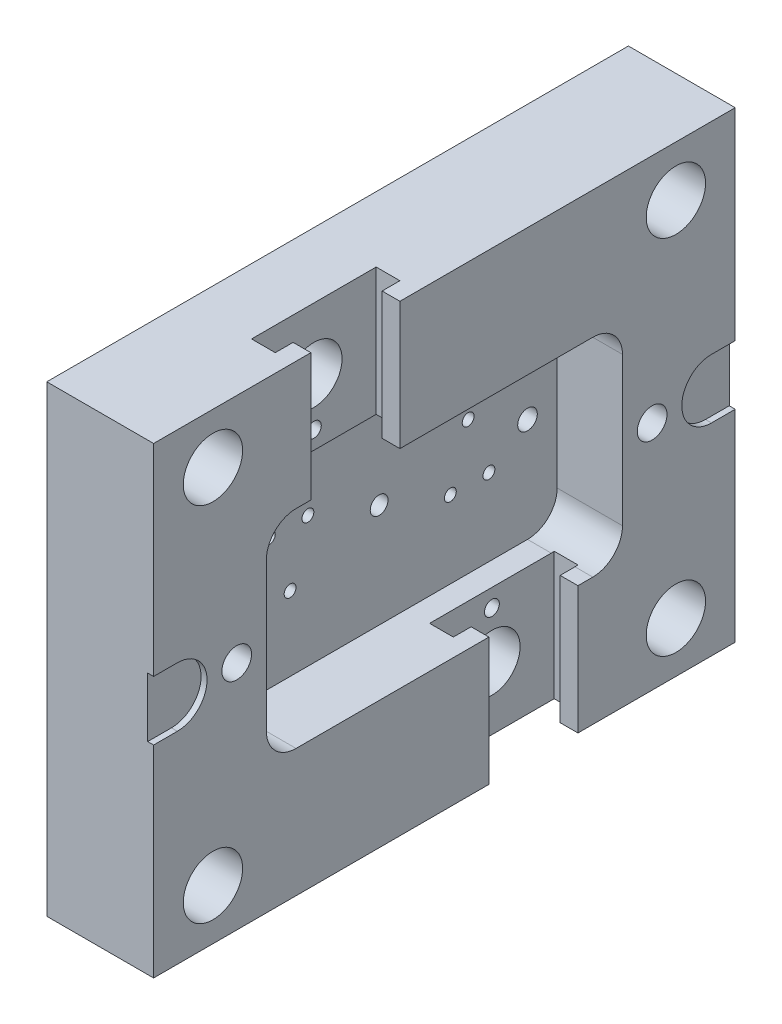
ISO-10303-21;
HEADER;
FILE_DESCRIPTION(('STEP AP214'),'2;1');
FILE_NAME('part.step','',(''),(''),'','','');
FILE_SCHEMA(('AUTOMOTIVE_DESIGN { 1 0 10303 214 1 1 1 1 }'));
ENDSEC;
DATA;
#1=APPLICATION_CONTEXT('core data for automotive mechanical design processes');
#2=APPLICATION_PROTOCOL_DEFINITION('international standard','automotive_design',2000,#1);
#3=PRODUCT_CONTEXT('',#1,'mechanical');
#4=PRODUCT('Part','Part','',(#3));
#5=PRODUCT_RELATED_PRODUCT_CATEGORY('part','',(#4));
#6=PRODUCT_DEFINITION_FORMATION('','',#4);
#7=PRODUCT_DEFINITION_CONTEXT('part definition',#1,'design');
#8=PRODUCT_DEFINITION('design','',#6,#7);
#9=PRODUCT_DEFINITION_SHAPE('','',#8);
#10=(LENGTH_UNIT() NAMED_UNIT(*) SI_UNIT(.MILLI.,.METRE.));
#11=(NAMED_UNIT(*) PLANE_ANGLE_UNIT() SI_UNIT($,.RADIAN.));
#12=(NAMED_UNIT(*) SI_UNIT($,.STERADIAN.) SOLID_ANGLE_UNIT());
#13=UNCERTAINTY_MEASURE_WITH_UNIT(LENGTH_MEASURE(1.E-05),#10,'distance_accuracy_value','');
#14=(GEOMETRIC_REPRESENTATION_CONTEXT(3) GLOBAL_UNCERTAINTY_ASSIGNED_CONTEXT((#13)) GLOBAL_UNIT_ASSIGNED_CONTEXT((#10,
#11,#12)) REPRESENTATION_CONTEXT('',''));
#15=CARTESIAN_POINT('',(0.,0.,0.));
#16=DIRECTION('',(0.,0.,1.));
#17=DIRECTION('',(1.,0.,0.));
#18=AXIS2_PLACEMENT_3D('',#15,#16,#17);
#19=CARTESIAN_POINT('',(-75.,78.0000000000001,98.0000000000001));
#20=DIRECTION('',(-1.,0.,0.));
#21=DIRECTION('',(0.,0.,1.));
#22=AXIS2_PLACEMENT_3D('',#19,#20,#21);
#23=PLANE('',#22);
#24=CARTESIAN_POINT('',(-75.,37.,68.));
#25=DIRECTION('',(1.,0.,0.));
#26=DIRECTION('',(0.,0.,-1.));
#27=AXIS2_PLACEMENT_3D('',#24,#25,#26);
#28=CIRCLE('',#27,2.5);
#29=CARTESIAN_POINT('',(-75.,37.,65.5));
#30=VERTEX_POINT('',#29);
#31=EDGE_CURVE('E395',#30,#30,#28,.T.);
#32=ORIENTED_EDGE('',*,*,#31,.T.);
#33=EDGE_LOOP('',(#32));
#34=FACE_BOUND('',#33,.T.);
#35=CARTESIAN_POINT('',(-75.,135.,128.));
#36=DIRECTION('',(1.,0.,0.));
#37=DIRECTION('',(0.,0.,-1.));
#38=AXIS2_PLACEMENT_3D('',#35,#36,#37);
#39=CIRCLE('',#38,9.50000000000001);
#40=CARTESIAN_POINT('',(-75.,135.,118.5));
#41=VERTEX_POINT('',#40);
#42=EDGE_CURVE('E404',#41,#41,#39,.T.);
#43=ORIENTED_EDGE('',*,*,#42,.T.);
#44=EDGE_LOOP('',(#43));
#45=FACE_BOUND('',#44,.T.);
#46=CARTESIAN_POINT('',(-75.,21.,68.));
#47=DIRECTION('',(1.,0.,0.));
#48=DIRECTION('',(0.,0.,-1.));
#49=AXIS2_PLACEMENT_3D('',#46,#47,#48);
#50=CIRCLE('',#49,9.5);
#51=CARTESIAN_POINT('',(-75.,21.,58.5));
#52=VERTEX_POINT('',#51);
#53=EDGE_CURVE('E410',#52,#52,#50,.T.);
#54=ORIENTED_EDGE('',*,*,#53,.T.);
#55=EDGE_LOOP('',(#54));
#56=FACE_BOUND('',#55,.T.);
#57=CARTESIAN_POINT('',(-75.,83.0000000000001,148.));
#58=DIRECTION('',(-1.,0.,0.));
#59=DIRECTION('',(0.,0.,1.));
#60=AXIS2_PLACEMENT_3D('',#57,#58,#59);
#61=CIRCLE('',#60,5.49999999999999);
#62=CARTESIAN_POINT('',(-75.,83.0000000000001,153.5));
#63=VERTEX_POINT('',#62);
#64=EDGE_CURVE('E419',#63,#63,#61,.T.);
#65=ORIENTED_EDGE('',*,*,#64,.F.);
#66=EDGE_LOOP('',(#65));
#67=FACE_BOUND('',#66,.T.);
#68=CARTESIAN_POINT('',(-75.,78.0000000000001,48.0000000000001));
#69=DIRECTION('',(-1.,0.,0.));
#70=DIRECTION('',(0.,0.,1.));
#71=AXIS2_PLACEMENT_3D('',#68,#69,#70);
#72=CIRCLE('',#71,5.49999999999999);
#73=CARTESIAN_POINT('',(-75.,78.0000000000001,53.5000000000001));
#74=VERTEX_POINT('',#73);
#75=EDGE_CURVE('E428',#74,#74,#72,.T.);
#76=ORIENTED_EDGE('',*,*,#75,.F.);
#77=EDGE_LOOP('',(#76));
#78=FACE_BOUND('',#77,.T.);
#79=CARTESIAN_POINT('',(-75.,78.0000000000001,28.));
#80=DIRECTION('',(-1.,0.,0.));
#81=DIRECTION('',(0.,0.,1.));
#82=AXIS2_PLACEMENT_3D('',#79,#80,#81);
#83=CIRCLE('',#82,5.);
#84=CARTESIAN_POINT('',(-75.,78.0000000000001,33.));
#85=VERTEX_POINT('',#84);
#86=EDGE_CURVE('E432',#85,#85,#83,.T.);
#87=ORIENTED_EDGE('',*,*,#86,.F.);
#88=EDGE_LOOP('',(#87));
#89=FACE_BOUND('',#88,.T.);
#90=CARTESIAN_POINT('',(-75.,78.0000000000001,168.));
#91=DIRECTION('',(-1.,0.,0.));
#92=DIRECTION('',(0.,0.,1.));
#93=AXIS2_PLACEMENT_3D('',#90,#91,#92);
#94=CIRCLE('',#93,5.00000000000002);
#95=CARTESIAN_POINT('',(-75.,78.0000000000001,173.));
#96=VERTEX_POINT('',#95);
#97=EDGE_CURVE('E438',#96,#96,#94,.T.);
#98=ORIENTED_EDGE('',*,*,#97,.F.);
#99=EDGE_LOOP('',(#98));
#100=FACE_BOUND('',#99,.T.);
#101=CARTESIAN_POINT('',(-75.,69.0000000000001,61.0000000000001));
#102=DIRECTION('',(1.,0.,0.));
#103=DIRECTION('',(0.,0.,-1.));
#104=AXIS2_PLACEMENT_3D('',#101,#102,#103);
#105=CIRCLE('',#104,2.);
#106=CARTESIAN_POINT('',(-75.,69.0000000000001,59.0000000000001));
#107=VERTEX_POINT('',#106);
#108=EDGE_CURVE('E476',#107,#107,#105,.T.);
#109=ORIENTED_EDGE('',*,*,#108,.T.);
#110=EDGE_LOOP('',(#109));
#111=FACE_BOUND('',#110,.T.);
#112=CARTESIAN_POINT('',(-75.,69.0000000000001,74.));
#113=DIRECTION('',(1.,0.,0.));
#114=DIRECTION('',(0.,0.,-1.));
#115=AXIS2_PLACEMENT_3D('',#112,#113,#114);
#116=CIRCLE('',#115,2.);
#117=CARTESIAN_POINT('',(-75.,69.0000000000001,72.));
#118=VERTEX_POINT('',#117);
#119=EDGE_CURVE('E482',#118,#118,#116,.T.);
#120=ORIENTED_EDGE('',*,*,#119,.T.);
#121=EDGE_LOOP('',(#120));
#122=FACE_BOUND('',#121,.T.);
#123=CARTESIAN_POINT('',(-75.,88.0000000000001,68.));
#124=DIRECTION('',(1.,0.,0.));
#125=DIRECTION('',(0.,0.,-1.));
#126=AXIS2_PLACEMENT_3D('',#123,#124,#125);
#127=CIRCLE('',#126,2.);
#128=CARTESIAN_POINT('',(-75.,88.0000000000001,66.));
#129=VERTEX_POINT('',#128);
#130=EDGE_CURVE('E488',#129,#129,#127,.T.);
#131=ORIENTED_EDGE('',*,*,#130,.T.);
#132=EDGE_LOOP('',(#131));
#133=FACE_BOUND('',#132,.T.);
#134=CARTESIAN_POINT('',(-75.,68.0000000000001,128.));
#135=DIRECTION('',(1.,0.,0.));
#136=DIRECTION('',(0.,0.,-1.));
#137=AXIS2_PLACEMENT_3D('',#134,#135,#136);
#138=CIRCLE('',#137,2.);
#139=CARTESIAN_POINT('',(-75.,68.0000000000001,126.));
#140=VERTEX_POINT('',#139);
#141=EDGE_CURVE('E494',#140,#140,#138,.T.);
#142=ORIENTED_EDGE('',*,*,#141,.T.);
#143=EDGE_LOOP('',(#142));
#144=FACE_BOUND('',#143,.T.);
#145=CARTESIAN_POINT('',(-75.,87.0000000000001,122.));
#146=DIRECTION('',(1.,0.,0.));
#147=DIRECTION('',(0.,0.,-1.));
#148=AXIS2_PLACEMENT_3D('',#145,#146,#147);
#149=CIRCLE('',#148,2.);
#150=CARTESIAN_POINT('',(-75.,87.0000000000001,120.));
#151=VERTEX_POINT('',#150);
#152=EDGE_CURVE('E500',#151,#151,#149,.T.);
#153=ORIENTED_EDGE('',*,*,#152,.T.);
#154=EDGE_LOOP('',(#153));
#155=FACE_BOUND('',#154,.T.);
#156=CARTESIAN_POINT('',(-75.,87.0000000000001,135.));
#157=DIRECTION('',(1.,0.,0.));
#158=DIRECTION('',(0.,0.,-1.));
#159=AXIS2_PLACEMENT_3D('',#156,#157,#158);
#160=CIRCLE('',#159,2.);
#161=CARTESIAN_POINT('',(-75.,87.0000000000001,133.));
#162=VERTEX_POINT('',#161);
#163=EDGE_CURVE('E506',#162,#162,#160,.T.);
#164=ORIENTED_EDGE('',*,*,#163,.T.);
#165=EDGE_LOOP('',(#164));
#166=FACE_BOUND('',#165,.T.);
#167=CARTESIAN_POINT('',(-75.,78.0000000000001,98.0000000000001));
#168=DIRECTION('',(-1.,0.,0.));
#169=DIRECTION('',(0.,0.,1.));
#170=AXIS2_PLACEMENT_3D('',#167,#168,#169);
#171=CIRCLE('',#170,3.00000000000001);
#172=CARTESIAN_POINT('',(-75.,78.0000000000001,101.));
#173=VERTEX_POINT('',#172);
#174=EDGE_CURVE('E720',#173,#173,#171,.T.);
#175=ORIENTED_EDGE('',*,*,#174,.F.);
#176=EDGE_LOOP('',(#175));
#177=FACE_BOUND('',#176,.T.);
#178=CARTESIAN_POINT('',(-75.,139.,155.));
#179=DIRECTION('',(-1.,0.,0.));
#180=DIRECTION('',(0.,0.,1.));
#181=AXIS2_PLACEMENT_3D('',#178,#179,#180);
#182=CIRCLE('',#181,4.25);
#183=CARTESIAN_POINT('',(-75.,139.,159.25));
#184=VERTEX_POINT('',#183);
#185=EDGE_CURVE('E723',#184,#184,#182,.T.);
#186=ORIENTED_EDGE('',*,*,#185,.F.);
#187=EDGE_LOOP('',(#186));
#188=FACE_BOUND('',#187,.T.);
#189=CARTESIAN_POINT('',(-75.,139.,41.));
#190=DIRECTION('',(-1.,0.,0.));
#191=DIRECTION('',(0.,0.,1.));
#192=AXIS2_PLACEMENT_3D('',#189,#190,#191);
#193=CIRCLE('',#192,4.25);
#194=CARTESIAN_POINT('',(-75.,139.,45.2500000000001));
#195=VERTEX_POINT('',#194);
#196=EDGE_CURVE('E823',#195,#195,#193,.T.);
#197=ORIENTED_EDGE('',*,*,#196,.F.);
#198=EDGE_LOOP('',(#197));
#199=FACE_BOUND('',#198,.T.);
#200=CARTESIAN_POINT('',(-75.,17.,155.));
#201=DIRECTION('',(-1.,0.,0.));
#202=DIRECTION('',(0.,0.,1.));
#203=AXIS2_PLACEMENT_3D('',#200,#201,#202);
#204=CIRCLE('',#203,4.25);
#205=CARTESIAN_POINT('',(-75.,17.,159.25));
#206=VERTEX_POINT('',#205);
#207=EDGE_CURVE('E820',#206,#206,#204,.T.);
#208=ORIENTED_EDGE('',*,*,#207,.F.);
#209=EDGE_LOOP('',(#208));
#210=FACE_BOUND('',#209,.T.);
#211=CARTESIAN_POINT('',(-75.,17.,41.));
#212=DIRECTION('',(-1.,0.,0.));
#213=DIRECTION('',(0.,0.,1.));
#214=AXIS2_PLACEMENT_3D('',#211,#212,#213);
#215=CIRCLE('',#214,4.25);
#216=CARTESIAN_POINT('',(-75.,17.,45.25));
#217=VERTEX_POINT('',#216);
#218=EDGE_CURVE('E736',#217,#217,#215,.T.);
#219=ORIENTED_EDGE('',*,*,#218,.F.);
#220=EDGE_LOOP('',(#219));
#221=FACE_BOUND('',#220,.T.);
#222=CARTESIAN_POINT('',(-75.,139.,176.));
#223=DIRECTION('',(-1.,0.,0.));
#224=DIRECTION('',(0.,0.,1.));
#225=AXIS2_PLACEMENT_3D('',#222,#223,#224);
#226=CIRCLE('',#225,13.);
#227=CARTESIAN_POINT('',(-75.,139.,189.));
#228=VERTEX_POINT('',#227);
#229=EDGE_CURVE('E744',#228,#228,#226,.T.);
#230=ORIENTED_EDGE('',*,*,#229,.F.);
#231=EDGE_LOOP('',(#230));
#232=FACE_BOUND('',#231,.T.);
#233=CARTESIAN_POINT('',(-75.,139.,20.));
#234=DIRECTION('',(-1.,0.,0.));
#235=DIRECTION('',(0.,0.,1.));
#236=AXIS2_PLACEMENT_3D('',#233,#234,#235);
#237=CIRCLE('',#236,13.);
#238=CARTESIAN_POINT('',(-75.,139.,33.));
#239=VERTEX_POINT('',#238);
#240=EDGE_CURVE('E752',#239,#239,#237,.T.);
#241=ORIENTED_EDGE('',*,*,#240,.F.);
#242=EDGE_LOOP('',(#241));
#243=FACE_BOUND('',#242,.T.);
#244=CARTESIAN_POINT('',(-75.,17.,176.));
#245=DIRECTION('',(-1.,0.,0.));
#246=DIRECTION('',(0.,0.,1.));
#247=AXIS2_PLACEMENT_3D('',#244,#245,#246);
#248=CIRCLE('',#247,13.);
#249=CARTESIAN_POINT('',(-75.,17.,189.));
#250=VERTEX_POINT('',#249);
#251=EDGE_CURVE('E760',#250,#250,#248,.T.);
#252=ORIENTED_EDGE('',*,*,#251,.F.);
#253=EDGE_LOOP('',(#252));
#254=FACE_BOUND('',#253,.T.);
#255=CARTESIAN_POINT('',(-75.,17.,20.));
#256=DIRECTION('',(-1.,0.,0.));
#257=DIRECTION('',(0.,0.,1.));
#258=AXIS2_PLACEMENT_3D('',#255,#256,#257);
#259=CIRCLE('',#258,13.);
#260=CARTESIAN_POINT('',(-75.,17.,33.));
#261=VERTEX_POINT('',#260);
#262=EDGE_CURVE('E803',#261,#261,#259,.T.);
#263=ORIENTED_EDGE('',*,*,#262,.F.);
#264=EDGE_LOOP('',(#263));
#265=FACE_BOUND('',#264,.T.);
#266=DIRECTION('',(0.,0.,-1.));
#267=VECTOR('',#266,1.);
#268=CARTESIAN_POINT('',(-75.,0.,98.0000000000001));
#269=LINE('',#268,#267);
#270=CARTESIAN_POINT('',(-75.,0.,196.));
#271=VERTEX_POINT('',#270);
#272=CARTESIAN_POINT('',(-75.,0.,0.));
#273=VERTEX_POINT('',#272);
#274=EDGE_CURVE('E798',#271,#273,#269,.T.);
#275=ORIENTED_EDGE('',*,*,#274,.F.);
#276=DIRECTION('',(0.,-1.,0.));
#277=VECTOR('',#276,1.);
#278=CARTESIAN_POINT('',(-75.,78.0000000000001,196.));
#279=LINE('',#278,#277);
#280=CARTESIAN_POINT('',(-75.,156.,196.));
#281=VERTEX_POINT('',#280);
#282=EDGE_CURVE('E791',#281,#271,#279,.T.);
#283=ORIENTED_EDGE('',*,*,#282,.F.);
#284=DIRECTION('',(0.,0.,1.));
#285=VECTOR('',#284,1.);
#286=CARTESIAN_POINT('',(-75.,156.,98.0000000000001));
#287=LINE('',#286,#285);
#288=CARTESIAN_POINT('',(-75.,156.,0.));
#289=VERTEX_POINT('',#288);
#290=EDGE_CURVE('E794',#289,#281,#287,.T.);
#291=ORIENTED_EDGE('',*,*,#290,.F.);
#292=DIRECTION('',(0.,1.,0.));
#293=VECTOR('',#292,1.);
#294=CARTESIAN_POINT('',(-75.,78.0000000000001,0.));
#295=LINE('',#294,#293);
#296=EDGE_CURVE('E796',#273,#289,#295,.T.);
#297=ORIENTED_EDGE('',*,*,#296,.F.);
#298=EDGE_LOOP('',(#275,#283,#291,#297));
#299=FACE_BOUND('',#298,.T.);
#300=CARTESIAN_POINT('',(-75.,119.,128.));
#301=DIRECTION('',(1.,0.,0.));
#302=DIRECTION('',(0.,0.,-1.));
#303=AXIS2_PLACEMENT_3D('',#300,#301,#302);
#304=CIRCLE('',#303,2.49999999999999);
#305=CARTESIAN_POINT('',(-75.,119.,125.5));
#306=VERTEX_POINT('',#305);
#307=EDGE_CURVE('E383',#306,#306,#304,.T.);
#308=ORIENTED_EDGE('',*,*,#307,.T.);
#309=EDGE_LOOP('',(#308));
#310=FACE_BOUND('',#309,.T.);
#311=ADVANCED_FACE('F46',(#34,#45,#56,#67,#78,#89,#100,#111,#122,#133,#144,#155,#166,#177,#188,
#199,#210,#221,#232,#243,#254,#265,#299,#310),#23,.T.);
#312=CARTESIAN_POINT('',(-68.,58.0000000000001,0.));
#313=DIRECTION('',(0.,0.,-1.));
#314=DIRECTION('',(-1.,0.,0.));
#315=AXIS2_PLACEMENT_3D('',#312,#313,#314);
#316=CYLINDRICAL_SURFACE('',#315,3.99999999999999);
#317=CARTESIAN_POINT('',(-68.,58.0000000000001,0.));
#318=DIRECTION('',(0.,0.,-1.));
#319=DIRECTION('',(-1.,0.,0.));
#320=AXIS2_PLACEMENT_3D('',#317,#318,#319);
#321=CIRCLE('',#320,4.);
#322=CARTESIAN_POINT('',(-72.,58.0000000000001,0.));
#323=VERTEX_POINT('',#322);
#324=EDGE_CURVE('E470',#323,#323,#321,.T.);
#325=ORIENTED_EDGE('',*,*,#324,.T.);
#326=EDGE_LOOP('',(#325));
#327=FACE_BOUND('',#326,.T.);
#328=CARTESIAN_POINT('',(-68.,58.0000000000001,114.));
#329=DIRECTION('',(0.,0.707106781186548,-0.707106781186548));
#330=DIRECTION('',(0.,-0.707106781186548,-0.707106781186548));
#331=AXIS2_PLACEMENT_3D('',#328,#329,#330);
#332=ELLIPSE('',#331,5.65685424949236,3.99999999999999);
#333=CARTESIAN_POINT('',(-72.,58.0000000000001,114.));
#334=VERTEX_POINT('',#333);
#335=CARTESIAN_POINT('',(-64.,58.0000000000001,114.));
#336=VERTEX_POINT('',#335);
#337=EDGE_CURVE('E450',#334,#336,#332,.F.);
#338=ORIENTED_EDGE('',*,*,#337,.T.);
#339=CARTESIAN_POINT('',(-68.,58.0000000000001,114.));
#340=DIRECTION('',(0.,-0.707106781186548,-0.707106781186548));
#341=DIRECTION('',(0.,0.707106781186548,-0.707106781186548));
#342=AXIS2_PLACEMENT_3D('',#339,#340,#341);
#343=ELLIPSE('',#342,5.65685424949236,3.99999999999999);
#344=EDGE_CURVE('E458',#336,#334,#343,.F.);
#345=ORIENTED_EDGE('',*,*,#344,.T.);
#346=EDGE_LOOP('',(#338,#345));
#347=FACE_BOUND('',#346,.T.);
#348=ADVANCED_FACE('F860',(#327,#347),#316,.F.);
#349=CARTESIAN_POINT('',(-68.,98.0000000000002,0.));
#350=DIRECTION('',(0.,0.,-1.));
#351=DIRECTION('',(-1.,0.,0.));
#352=AXIS2_PLACEMENT_3D('',#349,#350,#351);
#353=CYLINDRICAL_SURFACE('',#352,3.99999999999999);
#354=CARTESIAN_POINT('',(-68.,98.0000000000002,0.));
#355=DIRECTION('',(0.,0.,-1.));
#356=DIRECTION('',(-1.,0.,0.));
#357=AXIS2_PLACEMENT_3D('',#354,#355,#356);
#358=CIRCLE('',#357,4.);
#359=CARTESIAN_POINT('',(-72.,98.0000000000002,0.));
#360=VERTEX_POINT('',#359);
#361=EDGE_CURVE('E464',#360,#360,#358,.T.);
#362=ORIENTED_EDGE('',*,*,#361,.T.);
#363=EDGE_LOOP('',(#362));
#364=FACE_BOUND('',#363,.T.);
#365=CARTESIAN_POINT('',(-68.,98.0000000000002,114.));
#366=DIRECTION('',(0.,0.707106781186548,-0.707106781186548));
#367=DIRECTION('',(0.,-0.707106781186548,-0.707106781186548));
#368=AXIS2_PLACEMENT_3D('',#365,#366,#367);
#369=ELLIPSE('',#368,5.65685424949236,3.99999999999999);
#370=CARTESIAN_POINT('',(-72.,98.0000000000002,114.));
#371=VERTEX_POINT('',#370);
#372=CARTESIAN_POINT('',(-64.,98.0000000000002,114.));
#373=VERTEX_POINT('',#372);
#374=EDGE_CURVE('E800',#371,#373,#369,.F.);
#375=ORIENTED_EDGE('',*,*,#374,.T.);
#376=CARTESIAN_POINT('',(-68.,98.0000000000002,114.));
#377=DIRECTION('',(0.,-0.707106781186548,-0.707106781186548));
#378=DIRECTION('',(0.,0.707106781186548,-0.707106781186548));
#379=AXIS2_PLACEMENT_3D('',#376,#377,#378);
#380=ELLIPSE('',#379,5.65685424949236,3.99999999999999);
#381=EDGE_CURVE('E13',#373,#371,#380,.F.);
#382=ORIENTED_EDGE('',*,*,#381,.T.);
#383=EDGE_LOOP('',(#375,#382));
#384=FACE_BOUND('',#383,.T.);
#385=ADVANCED_FACE('F865',(#364,#384),#353,.F.);
#386=CARTESIAN_POINT('',(-39.,78.0000000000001,98.0000000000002));
#387=DIRECTION('',(1.,0.,0.));
#388=DIRECTION('',(0.,0.,-1.));
#389=AXIS2_PLACEMENT_3D('',#386,#387,#388);
#390=PLANE('',#389);
#391=DIRECTION('',(0.,0.,-1.));
#392=VECTOR('',#391,1.);
#393=CARTESIAN_POINT('',(-39.,68.0000000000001,196.));
#394=LINE('',#393,#392);
#395=CARTESIAN_POINT('',(-39.,68.0000000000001,196.));
#396=VERTEX_POINT('',#395);
#397=CARTESIAN_POINT('',(-39.,68.0000000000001,188.));
#398=VERTEX_POINT('',#397);
#399=EDGE_CURVE('E349',#396,#398,#394,.T.);
#400=ORIENTED_EDGE('',*,*,#399,.F.);
#401=DIRECTION('',(0.,1.,0.));
#402=VECTOR('',#401,1.);
#403=CARTESIAN_POINT('',(-39.,78.0000000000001,196.));
#404=LINE('',#403,#402);
#405=CARTESIAN_POINT('',(-39.,0.,196.));
#406=VERTEX_POINT('',#405);
#407=EDGE_CURVE('E769',#406,#396,#404,.T.);
#408=ORIENTED_EDGE('',*,*,#407,.F.);
#409=DIRECTION('',(0.,0.,1.));
#410=VECTOR('',#409,1.);
#411=CARTESIAN_POINT('',(-39.,0.,98.0000000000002));
#412=LINE('',#411,#410);
#413=CARTESIAN_POINT('',(-39.,0.,83.0000000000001));
#414=VERTEX_POINT('',#413);
#415=EDGE_CURVE('E768',#414,#406,#412,.T.);
#416=ORIENTED_EDGE('',*,*,#415,.F.);
#417=DIRECTION('',(0.,-1.,0.));
#418=VECTOR('',#417,1.);
#419=CARTESIAN_POINT('',(-39.,156.001,83.0000000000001));
#420=LINE('',#419,#418);
#421=CARTESIAN_POINT('',(-39.,43.0000000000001,83.0000000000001));
#422=VERTEX_POINT('',#421);
#423=EDGE_CURVE('E583',#422,#414,#420,.T.);
#424=ORIENTED_EDGE('',*,*,#423,.F.);
#425=DIRECTION('',(0.,0.,1.));
#426=VECTOR('',#425,1.);
#427=CARTESIAN_POINT('',(-39.,43.,48.0000000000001));
#428=LINE('',#427,#426);
#429=CARTESIAN_POINT('',(-39.,43.,148.));
#430=VERTEX_POINT('',#429);
#431=EDGE_CURVE('E675',#422,#430,#428,.T.);
#432=ORIENTED_EDGE('',*,*,#431,.T.);
#433=CARTESIAN_POINT('',(-39.,53.0000000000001,148.));
#434=DIRECTION('',(-1.,0.,0.));
#435=DIRECTION('',(0.,0.,1.));
#436=AXIS2_PLACEMENT_3D('',#433,#434,#435);
#437=CIRCLE('',#436,10.);
#438=CARTESIAN_POINT('',(-39.,53.0000000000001,158.));
#439=VERTEX_POINT('',#438);
#440=EDGE_CURVE('E598',#430,#439,#437,.T.);
#441=ORIENTED_EDGE('',*,*,#440,.T.);
#442=DIRECTION('',(0.,1.,0.));
#443=VECTOR('',#442,1.);
#444=CARTESIAN_POINT('',(-39.,103.,158.));
#445=LINE('',#444,#443);
#446=CARTESIAN_POINT('',(-39.,103.,158.));
#447=VERTEX_POINT('',#446);
#448=EDGE_CURVE('E656',#439,#447,#445,.T.);
#449=ORIENTED_EDGE('',*,*,#448,.T.);
#450=CARTESIAN_POINT('',(-39.,103.,148.));
#451=DIRECTION('',(-1.,0.,0.));
#452=DIRECTION('',(0.,0.,-1.));
#453=AXIS2_PLACEMENT_3D('',#450,#451,#452);
#454=CIRCLE('',#453,10.);
#455=CARTESIAN_POINT('',(-39.,113.,148.));
#456=VERTEX_POINT('',#455);
#457=EDGE_CURVE('E659',#447,#456,#454,.T.);
#458=ORIENTED_EDGE('',*,*,#457,.T.);
#459=DIRECTION('',(0.,0.,-1.));
#460=VECTOR('',#459,1.);
#461=CARTESIAN_POINT('',(-39.,113.,48.));
#462=LINE('',#461,#460);
#463=CARTESIAN_POINT('',(-39.,113.,143.));
#464=VERTEX_POINT('',#463);
#465=EDGE_CURVE('E663',#456,#464,#462,.T.);
#466=ORIENTED_EDGE('',*,*,#465,.T.);
#467=DIRECTION('',(0.,1.,0.));
#468=VECTOR('',#467,1.);
#469=CARTESIAN_POINT('',(-39.,-0.001000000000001,143.));
#470=LINE('',#469,#468);
#471=CARTESIAN_POINT('',(-39.,156.,143.));
#472=VERTEX_POINT('',#471);
#473=EDGE_CURVE('E621',#464,#472,#470,.T.);
#474=ORIENTED_EDGE('',*,*,#473,.T.);
#475=DIRECTION('',(0.,0.,-1.));
#476=VECTOR('',#475,1.);
#477=CARTESIAN_POINT('',(-39.,156.,98.0000000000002));
#478=LINE('',#477,#476);
#479=CARTESIAN_POINT('',(-39.,156.,196.));
#480=VERTEX_POINT('',#479);
#481=EDGE_CURVE('E773',#480,#472,#478,.T.);
#482=ORIENTED_EDGE('',*,*,#481,.F.);
#483=CARTESIAN_POINT('',(-39.,88.0000000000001,196.));
#484=VERTEX_POINT('',#483);
#485=EDGE_CURVE('E348',#484,#480,#404,.T.);
#486=ORIENTED_EDGE('',*,*,#485,.F.);
#487=DIRECTION('',(0.,0.,1.));
#488=VECTOR('',#487,1.);
#489=CARTESIAN_POINT('',(-39.,88.0000000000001,188.));
#490=LINE('',#489,#488);
#491=CARTESIAN_POINT('',(-39.,88.0000000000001,188.));
#492=VERTEX_POINT('',#491);
#493=EDGE_CURVE('E329',#492,#484,#490,.T.);
#494=ORIENTED_EDGE('',*,*,#493,.F.);
#495=CARTESIAN_POINT('',(-39.,78.0000000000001,188.));
#496=DIRECTION('',(1.,0.,0.));
#497=DIRECTION('',(0.,0.,-1.));
#498=AXIS2_PLACEMENT_3D('',#495,#496,#497);
#499=CIRCLE('',#498,10.);
#500=EDGE_CURVE('E337',#398,#492,#499,.T.);
#501=ORIENTED_EDGE('',*,*,#500,.F.);
#502=EDGE_LOOP('',(#400,#408,#416,#424,#432,#441,#449,#458,#466,#474,#482,#486,#494,#501));
#503=FACE_BOUND('',#502,.T.);
#504=CARTESIAN_POINT('',(-39.,78.0000000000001,168.));
#505=DIRECTION('',(-1.,0.,0.));
#506=DIRECTION('',(0.,0.,1.));
#507=AXIS2_PLACEMENT_3D('',#504,#505,#506);
#508=CIRCLE('',#507,5.00000000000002);
#509=CARTESIAN_POINT('',(-39.,78.0000000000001,173.));
#510=VERTEX_POINT('',#509);
#511=EDGE_CURVE('E441',#510,#510,#508,.T.);
#512=ORIENTED_EDGE('',*,*,#511,.T.);
#513=EDGE_LOOP('',(#512));
#514=FACE_BOUND('',#513,.T.);
#515=CARTESIAN_POINT('',(-39.,139.,176.));
#516=DIRECTION('',(1.,0.,0.));
#517=DIRECTION('',(0.,0.,-1.));
#518=AXIS2_PLACEMENT_3D('',#515,#516,#517);
#519=CIRCLE('',#518,10.);
#520=CARTESIAN_POINT('',(-39.,139.,166.));
#521=VERTEX_POINT('',#520);
#522=EDGE_CURVE('E739',#521,#521,#519,.T.);
#523=ORIENTED_EDGE('',*,*,#522,.F.);
#524=EDGE_LOOP('',(#523));
#525=FACE_BOUND('',#524,.T.);
#526=CARTESIAN_POINT('',(-39.,17.,176.));
#527=DIRECTION('',(1.,0.,0.));
#528=DIRECTION('',(0.,0.,-1.));
#529=AXIS2_PLACEMENT_3D('',#526,#527,#528);
#530=CIRCLE('',#529,10.);
#531=CARTESIAN_POINT('',(-39.,17.,166.));
#532=VERTEX_POINT('',#531);
#533=EDGE_CURVE('E755',#532,#532,#530,.T.);
#534=ORIENTED_EDGE('',*,*,#533,.F.);
#535=EDGE_LOOP('',(#534));
#536=FACE_BOUND('',#535,.T.);
#537=ADVANCED_FACE('F345',(#503,#514,#525,#536),#390,.T.);
#538=CARTESIAN_POINT('',(-61.,43.,48.0000000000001));
#539=DIRECTION('',(0.,1.,0.));
#540=DIRECTION('',(0.,0.,1.));
#541=AXIS2_PLACEMENT_3D('',#538,#539,#540);
#542=PLANE('',#541);
#543=DIRECTION('',(-1.,0.,0.));
#544=VECTOR('',#543,1.);
#545=CARTESIAN_POINT('',(-39.,43.,83.0000000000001));
#546=LINE('',#545,#544);
#547=CARTESIAN_POINT('',(-45.,43.,83.0000000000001));
#548=VERTEX_POINT('',#547);
#549=EDGE_CURVE('E525',#422,#548,#546,.T.);
#550=ORIENTED_EDGE('',*,*,#549,.T.);
#551=DIRECTION('',(0.,0.,1.));
#552=VECTOR('',#551,1.);
#553=CARTESIAN_POINT('',(-45.,43.,83.0000000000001));
#554=LINE('',#553,#552);
#555=CARTESIAN_POINT('',(-45.,43.,89.0000000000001));
#556=VERTEX_POINT('',#555);
#557=EDGE_CURVE('E528',#548,#556,#554,.T.);
#558=ORIENTED_EDGE('',*,*,#557,.T.);
#559=DIRECTION('',(-1.,0.,0.));
#560=VECTOR('',#559,1.);
#561=CARTESIAN_POINT('',(-45.,43.,89.0000000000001));
#562=LINE('',#561,#560);
#563=CARTESIAN_POINT('',(-53.,43.,89.0000000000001));
#564=VERTEX_POINT('',#563);
#565=EDGE_CURVE('E531',#556,#564,#562,.T.);
#566=ORIENTED_EDGE('',*,*,#565,.T.);
#567=DIRECTION('',(0.,0.,-1.));
#568=VECTOR('',#567,1.);
#569=CARTESIAN_POINT('',(-53.,43.,89.0000000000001));
#570=LINE('',#569,#568);
#571=CARTESIAN_POINT('',(-53.,43.,48.0000000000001));
#572=VERTEX_POINT('',#571);
#573=EDGE_CURVE('E534',#564,#572,#570,.T.);
#574=ORIENTED_EDGE('',*,*,#573,.T.);
#575=DIRECTION('',(1.,0.,0.));
#576=VECTOR('',#575,1.);
#577=CARTESIAN_POINT('',(-61.,43.,48.0000000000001));
#578=LINE('',#577,#576);
#579=CARTESIAN_POINT('',(-61.,43.,48.0000000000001));
#580=VERTEX_POINT('',#579);
#581=EDGE_CURVE('E700',#580,#572,#578,.T.);
#582=ORIENTED_EDGE('',*,*,#581,.F.);
#583=DIRECTION('',(0.,0.,1.));
#584=VECTOR('',#583,1.);
#585=CARTESIAN_POINT('',(-61.,43.,48.0000000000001));
#586=LINE('',#585,#584);
#587=CARTESIAN_POINT('',(-61.,43.,148.));
#588=VERTEX_POINT('',#587);
#589=EDGE_CURVE('E694',#580,#588,#586,.T.);
#590=ORIENTED_EDGE('',*,*,#589,.T.);
#591=DIRECTION('',(1.,0.,0.));
#592=VECTOR('',#591,1.);
#593=CARTESIAN_POINT('',(-61.,43.,148.));
#594=LINE('',#593,#592);
#595=EDGE_CURVE('E696',#588,#430,#594,.T.);
#596=ORIENTED_EDGE('',*,*,#595,.T.);
#597=ORIENTED_EDGE('',*,*,#431,.F.);
#598=EDGE_LOOP('',(#550,#558,#566,#574,#582,#590,#596,#597));
#599=FACE_BOUND('',#598,.T.);
#600=ADVANCED_FACE('F1032',(#599),#542,.T.);
#601=CARTESIAN_POINT('',(-61.,113.,48.));
#602=DIRECTION('',(0.,-1.,0.));
#603=DIRECTION('',(0.,0.,-1.));
#604=AXIS2_PLACEMENT_3D('',#601,#602,#603);
#605=PLANE('',#604);
#606=DIRECTION('',(1.,0.,0.));
#607=VECTOR('',#606,1.);
#608=CARTESIAN_POINT('',(-39.,113.,143.));
#609=LINE('',#608,#607);
#610=CARTESIAN_POINT('',(-45.,113.,143.));
#611=VERTEX_POINT('',#610);
#612=EDGE_CURVE('E589',#611,#464,#609,.T.);
#613=ORIENTED_EDGE('',*,*,#612,.T.);
#614=ORIENTED_EDGE('',*,*,#465,.F.);
#615=DIRECTION('',(1.,0.,0.));
#616=VECTOR('',#615,1.);
#617=CARTESIAN_POINT('',(-61.,113.,148.));
#618=LINE('',#617,#616);
#619=CARTESIAN_POINT('',(-45.,113.,148.));
#620=VERTEX_POINT('',#619);
#621=EDGE_CURVE('E710',#620,#456,#618,.T.);
#622=ORIENTED_EDGE('',*,*,#621,.F.);
#623=DIRECTION('',(0.,0.,-1.));
#624=VECTOR('',#623,1.);
#625=CARTESIAN_POINT('',(-45.,113.,143.));
#626=LINE('',#625,#624);
#627=EDGE_CURVE('E620',#620,#611,#626,.T.);
#628=ORIENTED_EDGE('',*,*,#627,.T.);
#629=EDGE_LOOP('',(#613,#614,#622,#628));
#630=FACE_BOUND('',#629,.T.);
#631=ADVANCED_FACE('F1017',(#630),#605,.T.);
#632=DIRECTION('',(0.,0.,1.));
#633=VECTOR('',#632,1.);
#634=CARTESIAN_POINT('',(-39.,88.0000000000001,8.00000000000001));
#635=LINE('',#634,#633);
#636=CARTESIAN_POINT('',(-39.,88.0000000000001,0.));
#637=VERTEX_POINT('',#636);
#638=CARTESIAN_POINT('',(-39.,88.0000000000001,8.00000000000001));
#639=VERTEX_POINT('',#638);
#640=EDGE_CURVE('E369',#637,#639,#635,.T.);
#641=ORIENTED_EDGE('',*,*,#640,.F.);
#642=DIRECTION('',(0.,-1.,0.));
#643=VECTOR('',#642,1.);
#644=CARTESIAN_POINT('',(-39.,78.0000000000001,0.));
#645=LINE('',#644,#643);
#646=CARTESIAN_POINT('',(-39.,156.,0.));
#647=VERTEX_POINT('',#646);
#648=EDGE_CURVE('E777',#647,#637,#645,.T.);
#649=ORIENTED_EDGE('',*,*,#648,.F.);
#650=CARTESIAN_POINT('',(-39.,156.,113.));
#651=VERTEX_POINT('',#650);
#652=EDGE_CURVE('E776',#651,#647,#478,.T.);
#653=ORIENTED_EDGE('',*,*,#652,.F.);
#654=DIRECTION('',(0.,1.,0.));
#655=VECTOR('',#654,1.);
#656=CARTESIAN_POINT('',(-39.,-0.001000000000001,113.));
#657=LINE('',#656,#655);
#658=CARTESIAN_POINT('',(-39.,113.,113.));
#659=VERTEX_POINT('',#658);
#660=EDGE_CURVE('E625',#659,#651,#657,.T.);
#661=ORIENTED_EDGE('',*,*,#660,.F.);
#662=CARTESIAN_POINT('',(-39.,113.,48.));
#663=VERTEX_POINT('',#662);
#664=EDGE_CURVE('E662',#659,#663,#462,.T.);
#665=ORIENTED_EDGE('',*,*,#664,.T.);
#666=CARTESIAN_POINT('',(-39.,103.,48.));
#667=DIRECTION('',(-1.,0.,0.));
#668=DIRECTION('',(0.,0.,1.));
#669=AXIS2_PLACEMENT_3D('',#666,#667,#668);
#670=CIRCLE('',#669,9.99999999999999);
#671=CARTESIAN_POINT('',(-39.,103.,38.));
#672=VERTEX_POINT('',#671);
#673=EDGE_CURVE('E666',#663,#672,#670,.T.);
#674=ORIENTED_EDGE('',*,*,#673,.T.);
#675=DIRECTION('',(0.,-1.,0.));
#676=VECTOR('',#675,1.);
#677=CARTESIAN_POINT('',(-39.,103.,38.));
#678=LINE('',#677,#676);
#679=CARTESIAN_POINT('',(-39.,53.0000000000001,38.));
#680=VERTEX_POINT('',#679);
#681=EDGE_CURVE('E669',#672,#680,#678,.T.);
#682=ORIENTED_EDGE('',*,*,#681,.T.);
#683=CARTESIAN_POINT('',(-39.,53.0000000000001,48.0000000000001));
#684=DIRECTION('',(-1.,0.,0.));
#685=DIRECTION('',(0.,0.,1.));
#686=AXIS2_PLACEMENT_3D('',#683,#684,#685);
#687=CIRCLE('',#686,10.);
#688=CARTESIAN_POINT('',(-39.,43.,48.0000000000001));
#689=VERTEX_POINT('',#688);
#690=EDGE_CURVE('E672',#680,#689,#687,.T.);
#691=ORIENTED_EDGE('',*,*,#690,.T.);
#692=CARTESIAN_POINT('',(-39.,43.,53.0000000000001));
#693=VERTEX_POINT('',#692);
#694=EDGE_CURVE('E676',#689,#693,#428,.T.);
#695=ORIENTED_EDGE('',*,*,#694,.T.);
#696=DIRECTION('',(0.,-1.,0.));
#697=VECTOR('',#696,1.);
#698=CARTESIAN_POINT('',(-39.,156.001,53.0000000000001));
#699=LINE('',#698,#697);
#700=CARTESIAN_POINT('',(-39.,0.,53.0000000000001));
#701=VERTEX_POINT('',#700);
#702=EDGE_CURVE('E569',#693,#701,#699,.T.);
#703=ORIENTED_EDGE('',*,*,#702,.T.);
#704=CARTESIAN_POINT('',(-39.,0.,0.));
#705=VERTEX_POINT('',#704);
#706=EDGE_CURVE('E764',#705,#701,#412,.T.);
#707=ORIENTED_EDGE('',*,*,#706,.F.);
#708=CARTESIAN_POINT('',(-39.,68.0000000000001,0.));
#709=VERTEX_POINT('',#708);
#710=EDGE_CURVE('E767',#709,#705,#645,.T.);
#711=ORIENTED_EDGE('',*,*,#710,.F.);
#712=DIRECTION('',(0.,0.,-1.));
#713=VECTOR('',#712,1.);
#714=CARTESIAN_POINT('',(-39.,68.0000000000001,0.));
#715=LINE('',#714,#713);
#716=CARTESIAN_POINT('',(-39.,68.0000000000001,8.00000000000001));
#717=VERTEX_POINT('',#716);
#718=EDGE_CURVE('E367',#717,#709,#715,.T.);
#719=ORIENTED_EDGE('',*,*,#718,.F.);
#720=CARTESIAN_POINT('',(-39.,78.0000000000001,8.00000000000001));
#721=DIRECTION('',(1.,0.,0.));
#722=DIRECTION('',(0.,0.,-1.));
#723=AXIS2_PLACEMENT_3D('',#720,#721,#722);
#724=CIRCLE('',#723,10.);
#725=EDGE_CURVE('E361',#639,#717,#724,.T.);
#726=ORIENTED_EDGE('',*,*,#725,.F.);
#727=EDGE_LOOP('',(#641,#649,#653,#661,#665,#674,#682,#691,#695,#703,#707,#711,#719,#726));
#728=FACE_BOUND('',#727,.T.);
#729=CARTESIAN_POINT('',(-39.,78.0000000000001,28.));
#730=DIRECTION('',(-1.,0.,0.));
#731=DIRECTION('',(0.,0.,1.));
#732=AXIS2_PLACEMENT_3D('',#729,#730,#731);
#733=CIRCLE('',#732,5.);
#734=CARTESIAN_POINT('',(-39.,78.0000000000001,33.));
#735=VERTEX_POINT('',#734);
#736=EDGE_CURVE('E435',#735,#735,#733,.T.);
#737=ORIENTED_EDGE('',*,*,#736,.T.);
#738=EDGE_LOOP('',(#737));
#739=FACE_BOUND('',#738,.T.);
#740=CARTESIAN_POINT('',(-39.,17.,20.));
#741=DIRECTION('',(1.,0.,0.));
#742=DIRECTION('',(0.,0.,-1.));
#743=AXIS2_PLACEMENT_3D('',#740,#741,#742);
#744=CIRCLE('',#743,10.);
#745=CARTESIAN_POINT('',(-39.,17.,10.));
#746=VERTEX_POINT('',#745);
#747=EDGE_CURVE('E763',#746,#746,#744,.T.);
#748=ORIENTED_EDGE('',*,*,#747,.F.);
#749=EDGE_LOOP('',(#748));
#750=FACE_BOUND('',#749,.T.);
#751=CARTESIAN_POINT('',(-39.,139.,20.));
#752=DIRECTION('',(1.,0.,0.));
#753=DIRECTION('',(0.,0.,-1.));
#754=AXIS2_PLACEMENT_3D('',#751,#752,#753);
#755=CIRCLE('',#754,10.);
#756=CARTESIAN_POINT('',(-39.,139.,9.99999999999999));
#757=VERTEX_POINT('',#756);
#758=EDGE_CURVE('E747',#757,#757,#755,.T.);
#759=ORIENTED_EDGE('',*,*,#758,.F.);
#760=EDGE_LOOP('',(#759));
#761=FACE_BOUND('',#760,.T.);
#762=ADVANCED_FACE('F977',(#728,#739,#750,#761),#390,.T.);
#763=CARTESIAN_POINT('',(-39.,0.,98.0000000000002));
#764=DIRECTION('',(0.,-1.,0.));
#765=DIRECTION('',(1.,0.,0.));
#766=AXIS2_PLACEMENT_3D('',#763,#764,#765);
#767=PLANE('',#766);
#768=CARTESIAN_POINT('',(-68.,0.,114.));
#769=DIRECTION('',(0.,-1.,0.));
#770=DIRECTION('',(0.,0.,-1.));
#771=AXIS2_PLACEMENT_3D('',#768,#769,#770);
#772=CIRCLE('',#771,3.99999999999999);
#773=CARTESIAN_POINT('',(-68.,0.,110.));
#774=VERTEX_POINT('',#773);
#775=EDGE_CURVE('E447',#774,#774,#772,.T.);
#776=ORIENTED_EDGE('',*,*,#775,.F.);
#777=EDGE_LOOP('',(#776));
#778=FACE_BOUND('',#777,.T.);
#779=DIRECTION('',(-1.,0.,0.));
#780=VECTOR('',#779,1.);
#781=CARTESIAN_POINT('',(-39.,0.,83.0000000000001));
#782=LINE('',#781,#780);
#783=CARTESIAN_POINT('',(-45.,0.,83.0000000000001));
#784=VERTEX_POINT('',#783);
#785=EDGE_CURVE('E551',#414,#784,#782,.T.);
#786=ORIENTED_EDGE('',*,*,#785,.F.);
#787=ORIENTED_EDGE('',*,*,#415,.T.);
#788=DIRECTION('',(-1.,0.,0.));
#789=VECTOR('',#788,1.);
#790=CARTESIAN_POINT('',(-39.,0.,196.));
#791=LINE('',#790,#789);
#792=EDGE_CURVE('E772',#406,#271,#791,.T.);
#793=ORIENTED_EDGE('',*,*,#792,.T.);
#794=ORIENTED_EDGE('',*,*,#274,.T.);
#795=DIRECTION('',(-1.,0.,0.));
#796=VECTOR('',#795,1.);
#797=CARTESIAN_POINT('',(-39.,0.,0.));
#798=LINE('',#797,#796);
#799=EDGE_CURVE('E788',#705,#273,#798,.T.);
#800=ORIENTED_EDGE('',*,*,#799,.F.);
#801=ORIENTED_EDGE('',*,*,#706,.T.);
#802=DIRECTION('',(1.,0.,0.));
#803=VECTOR('',#802,1.);
#804=CARTESIAN_POINT('',(-45.,0.,53.0000000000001));
#805=LINE('',#804,#803);
#806=CARTESIAN_POINT('',(-45.,0.,53.0000000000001));
#807=VERTEX_POINT('',#806);
#808=EDGE_CURVE('E549',#807,#701,#805,.T.);
#809=ORIENTED_EDGE('',*,*,#808,.F.);
#810=DIRECTION('',(0.,0.,1.));
#811=VECTOR('',#810,1.);
#812=CARTESIAN_POINT('',(-45.,0.,47.0000000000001));
#813=LINE('',#812,#811);
#814=CARTESIAN_POINT('',(-45.,0.,47.0000000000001));
#815=VERTEX_POINT('',#814);
#816=EDGE_CURVE('E566',#815,#807,#813,.T.);
#817=ORIENTED_EDGE('',*,*,#816,.F.);
#818=DIRECTION('',(1.,0.,0.));
#819=VECTOR('',#818,1.);
#820=CARTESIAN_POINT('',(-53.,0.,47.0000000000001));
#821=LINE('',#820,#819);
#822=CARTESIAN_POINT('',(-53.,0.,47.0000000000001));
#823=VERTEX_POINT('',#822);
#824=EDGE_CURVE('E563',#823,#815,#821,.T.);
#825=ORIENTED_EDGE('',*,*,#824,.F.);
#826=DIRECTION('',(0.,0.,-1.));
#827=VECTOR('',#826,1.);
#828=CARTESIAN_POINT('',(-53.,0.,89.0000000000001));
#829=LINE('',#828,#827);
#830=CARTESIAN_POINT('',(-53.,0.,89.0000000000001));
#831=VERTEX_POINT('',#830);
#832=EDGE_CURVE('E560',#831,#823,#829,.T.);
#833=ORIENTED_EDGE('',*,*,#832,.F.);
#834=DIRECTION('',(-1.,0.,0.));
#835=VECTOR('',#834,1.);
#836=CARTESIAN_POINT('',(-45.,0.,89.0000000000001));
#837=LINE('',#836,#835);
#838=CARTESIAN_POINT('',(-45.,0.,89.0000000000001));
#839=VERTEX_POINT('',#838);
#840=EDGE_CURVE('E557',#839,#831,#837,.T.);
#841=ORIENTED_EDGE('',*,*,#840,.F.);
#842=DIRECTION('',(0.,0.,1.));
#843=VECTOR('',#842,1.);
#844=CARTESIAN_POINT('',(-45.,0.,83.0000000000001));
#845=LINE('',#844,#843);
#846=EDGE_CURVE('E554',#784,#839,#845,.T.);
#847=ORIENTED_EDGE('',*,*,#846,.F.);
#848=EDGE_LOOP('',(#786,#787,#793,#794,#800,#801,#809,#817,#825,#833,#841,#847));
#849=FACE_BOUND('',#848,.T.);
#850=ADVANCED_FACE('F1006',(#778,#849),#767,.T.);
#851=CARTESIAN_POINT('',(-39.,78.0000000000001,0.));
#852=DIRECTION('',(0.,0.,-1.));
#853=DIRECTION('',(-1.,0.,0.));
#854=AXIS2_PLACEMENT_3D('',#851,#852,#853);
#855=PLANE('',#854);
#856=DIRECTION('',(1.,0.,0.));
#857=VECTOR('',#856,1.);
#858=CARTESIAN_POINT('',(-41.,88.0000000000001,0.));
#859=LINE('',#858,#857);
#860=CARTESIAN_POINT('',(-41.,88.0000000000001,0.));
#861=VERTEX_POINT('',#860);
#862=EDGE_CURVE('E384',#861,#637,#859,.T.);
#863=ORIENTED_EDGE('',*,*,#862,.F.);
#864=DIRECTION('',(0.,1.,0.));
#865=VECTOR('',#864,1.);
#866=CARTESIAN_POINT('',(-41.,88.0000000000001,0.));
#867=LINE('',#866,#865);
#868=CARTESIAN_POINT('',(-41.,68.0000000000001,0.));
#869=VERTEX_POINT('',#868);
#870=EDGE_CURVE('E375',#869,#861,#867,.T.);
#871=ORIENTED_EDGE('',*,*,#870,.F.);
#872=DIRECTION('',(1.,0.,0.));
#873=VECTOR('',#872,1.);
#874=CARTESIAN_POINT('',(-41.,68.0000000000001,0.));
#875=LINE('',#874,#873);
#876=EDGE_CURVE('E386',#869,#709,#875,.T.);
#877=ORIENTED_EDGE('',*,*,#876,.T.);
#878=ORIENTED_EDGE('',*,*,#710,.T.);
#879=ORIENTED_EDGE('',*,*,#799,.T.);
#880=ORIENTED_EDGE('',*,*,#296,.T.);
#881=DIRECTION('',(-1.,0.,0.));
#882=VECTOR('',#881,1.);
#883=CARTESIAN_POINT('',(-39.,156.,0.));
#884=LINE('',#883,#882);
#885=EDGE_CURVE('E785',#647,#289,#884,.T.);
#886=ORIENTED_EDGE('',*,*,#885,.F.);
#887=ORIENTED_EDGE('',*,*,#648,.T.);
#888=EDGE_LOOP('',(#863,#871,#877,#878,#879,#880,#886,#887));
#889=FACE_BOUND('',#888,.T.);
#890=ORIENTED_EDGE('',*,*,#361,.F.);
#891=EDGE_LOOP('',(#890));
#892=FACE_BOUND('',#891,.T.);
#893=ORIENTED_EDGE('',*,*,#324,.F.);
#894=EDGE_LOOP('',(#893));
#895=FACE_BOUND('',#894,.T.);
#896=ADVANCED_FACE('F987',(#889,#892,#895),#855,.T.);
#897=CARTESIAN_POINT('',(-39.,156.,98.0000000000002));
#898=DIRECTION('',(0.,1.,0.));
#899=DIRECTION('',(-1.,0.,0.));
#900=AXIS2_PLACEMENT_3D('',#897,#898,#899);
#901=PLANE('',#900);
#902=DIRECTION('',(-1.,0.,0.));
#903=VECTOR('',#902,1.);
#904=CARTESIAN_POINT('',(-45.,156.,113.));
#905=LINE('',#904,#903);
#906=CARTESIAN_POINT('',(-45.,156.,113.));
#907=VERTEX_POINT('',#906);
#908=EDGE_CURVE('E611',#651,#907,#905,.T.);
#909=ORIENTED_EDGE('',*,*,#908,.F.);
#910=ORIENTED_EDGE('',*,*,#652,.T.);
#911=ORIENTED_EDGE('',*,*,#885,.T.);
#912=ORIENTED_EDGE('',*,*,#290,.T.);
#913=DIRECTION('',(-1.,0.,0.));
#914=VECTOR('',#913,1.);
#915=CARTESIAN_POINT('',(-39.,156.,196.));
#916=LINE('',#915,#914);
#917=EDGE_CURVE('E782',#480,#281,#916,.T.);
#918=ORIENTED_EDGE('',*,*,#917,.F.);
#919=ORIENTED_EDGE('',*,*,#481,.T.);
#920=DIRECTION('',(1.,0.,0.));
#921=VECTOR('',#920,1.);
#922=CARTESIAN_POINT('',(-39.,156.,143.));
#923=LINE('',#922,#921);
#924=CARTESIAN_POINT('',(-45.,156.,143.));
#925=VERTEX_POINT('',#924);
#926=EDGE_CURVE('E614',#925,#472,#923,.T.);
#927=ORIENTED_EDGE('',*,*,#926,.F.);
#928=DIRECTION('',(0.,0.,-1.));
#929=VECTOR('',#928,1.);
#930=CARTESIAN_POINT('',(-45.,156.,143.));
#931=LINE('',#930,#929);
#932=CARTESIAN_POINT('',(-45.,156.,149.));
#933=VERTEX_POINT('',#932);
#934=EDGE_CURVE('E595',#933,#925,#931,.T.);
#935=ORIENTED_EDGE('',*,*,#934,.F.);
#936=DIRECTION('',(1.,0.,0.));
#937=VECTOR('',#936,1.);
#938=CARTESIAN_POINT('',(-45.,156.,149.));
#939=LINE('',#938,#937);
#940=CARTESIAN_POINT('',(-53.,156.,149.));
#941=VERTEX_POINT('',#940);
#942=EDGE_CURVE('E599',#941,#933,#939,.T.);
#943=ORIENTED_EDGE('',*,*,#942,.F.);
#944=DIRECTION('',(0.,0.,1.));
#945=VECTOR('',#944,1.);
#946=CARTESIAN_POINT('',(-53.,156.,149.));
#947=LINE('',#946,#945);
#948=CARTESIAN_POINT('',(-53.,156.,107.));
#949=VERTEX_POINT('',#948);
#950=EDGE_CURVE('E602',#949,#941,#947,.T.);
#951=ORIENTED_EDGE('',*,*,#950,.F.);
#952=DIRECTION('',(-1.,0.,0.));
#953=VECTOR('',#952,1.);
#954=CARTESIAN_POINT('',(-53.,156.,107.));
#955=LINE('',#954,#953);
#956=CARTESIAN_POINT('',(-45.,156.,107.));
#957=VERTEX_POINT('',#956);
#958=EDGE_CURVE('E605',#957,#949,#955,.T.);
#959=ORIENTED_EDGE('',*,*,#958,.F.);
#960=DIRECTION('',(0.,0.,-1.));
#961=VECTOR('',#960,1.);
#962=CARTESIAN_POINT('',(-45.,156.,107.));
#963=LINE('',#962,#961);
#964=EDGE_CURVE('E608',#907,#957,#963,.T.);
#965=ORIENTED_EDGE('',*,*,#964,.F.);
#966=EDGE_LOOP('',(#909,#910,#911,#912,#918,#919,#927,#935,#943,#951,#959,#965));
#967=FACE_BOUND('',#966,.T.);
#968=ADVANCED_FACE('F950',(#967),#901,.T.);
#969=CARTESIAN_POINT('',(-39.,78.0000000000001,196.));
#970=DIRECTION('',(0.,0.,1.));
#971=DIRECTION('',(1.,0.,0.));
#972=AXIS2_PLACEMENT_3D('',#969,#970,#971);
#973=PLANE('',#972);
#974=DIRECTION('',(1.,0.,0.));
#975=VECTOR('',#974,1.);
#976=CARTESIAN_POINT('',(-41.,68.0000000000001,196.));
#977=LINE('',#976,#975);
#978=CARTESIAN_POINT('',(-41.,68.0000000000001,196.));
#979=VERTEX_POINT('',#978);
#980=EDGE_CURVE('E362',#979,#396,#977,.T.);
#981=ORIENTED_EDGE('',*,*,#980,.F.);
#982=DIRECTION('',(0.,-1.,0.));
#983=VECTOR('',#982,1.);
#984=CARTESIAN_POINT('',(-41.,88.0000000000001,196.));
#985=LINE('',#984,#983);
#986=CARTESIAN_POINT('',(-41.,88.0000000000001,196.));
#987=VERTEX_POINT('',#986);
#988=EDGE_CURVE('E356',#987,#979,#985,.T.);
#989=ORIENTED_EDGE('',*,*,#988,.F.);
#990=DIRECTION('',(1.,0.,0.));
#991=VECTOR('',#990,1.);
#992=CARTESIAN_POINT('',(-41.,88.0000000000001,196.));
#993=LINE('',#992,#991);
#994=EDGE_CURVE('E333',#987,#484,#993,.T.);
#995=ORIENTED_EDGE('',*,*,#994,.T.);
#996=ORIENTED_EDGE('',*,*,#485,.T.);
#997=ORIENTED_EDGE('',*,*,#917,.T.);
#998=ORIENTED_EDGE('',*,*,#282,.T.);
#999=ORIENTED_EDGE('',*,*,#792,.F.);
#1000=ORIENTED_EDGE('',*,*,#407,.T.);
#1001=EDGE_LOOP('',(#981,#989,#995,#996,#997,#998,#999,#1000));
#1002=FACE_BOUND('',#1001,.T.);
#1003=ADVANCED_FACE('F1069',(#1002),#973,.T.);
#1004=CARTESIAN_POINT('',(3.00000000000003,17.,20.));
#1005=DIRECTION('',(-1.,0.,0.));
#1006=DIRECTION('',(0.,1.,0.));
#1007=AXIS2_PLACEMENT_3D('',#1004,#1005,#1006);
#1008=CYLINDRICAL_SURFACE('',#1007,10.);
#1009=ORIENTED_EDGE('',*,*,#747,.T.);
#1010=EDGE_LOOP('',(#1009));
#1011=FACE_BOUND('',#1010,.T.);
#1012=CARTESIAN_POINT('',(-69.,17.,20.));
#1013=DIRECTION('',(1.,0.,0.));
#1014=DIRECTION('',(0.,0.,-1.));
#1015=AXIS2_PLACEMENT_3D('',#1012,#1013,#1014);
#1016=CIRCLE('',#1015,10.);
#1017=CARTESIAN_POINT('',(-69.,17.,9.99999999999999));
#1018=VERTEX_POINT('',#1017);
#1019=EDGE_CURVE('E759',#1018,#1018,#1016,.F.);
#1020=ORIENTED_EDGE('',*,*,#1019,.T.);
#1021=EDGE_LOOP('',(#1020));
#1022=FACE_BOUND('',#1021,.T.);
#1023=ADVANCED_FACE('F1667',(#1011,#1022),#1008,.F.);
#1024=CARTESIAN_POINT('',(-69.,17.,20.));
#1025=DIRECTION('',(1.,0.,0.));
#1026=DIRECTION('',(0.,0.,-1.));
#1027=AXIS2_PLACEMENT_3D('',#1024,#1025,#1026);
#1028=PLANE('',#1027);
#1029=ORIENTED_EDGE('',*,*,#1019,.F.);
#1030=EDGE_LOOP('',(#1029));
#1031=FACE_BOUND('',#1030,.T.);
#1032=CARTESIAN_POINT('',(-69.,17.,20.));
#1033=DIRECTION('',(-1.,0.,0.));
#1034=DIRECTION('',(0.,-1.,0.));
#1035=AXIS2_PLACEMENT_3D('',#1032,#1033,#1034);
#1036=CIRCLE('',#1035,13.);
#1037=CARTESIAN_POINT('',(-69.,3.99999999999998,20.));
#1038=VERTEX_POINT('',#1037);
#1039=EDGE_CURVE('E756',#1038,#1038,#1036,.T.);
#1040=ORIENTED_EDGE('',*,*,#1039,.T.);
#1041=EDGE_LOOP('',(#1040));
#1042=FACE_BOUND('',#1041,.T.);
#1043=ADVANCED_FACE('F1662',(#1031,#1042),#1028,.F.);
#1044=CARTESIAN_POINT('',(-78.,17.,20.));
#1045=DIRECTION('',(1.,0.,0.));
#1046=DIRECTION('',(0.,-1.,0.));
#1047=AXIS2_PLACEMENT_3D('',#1044,#1045,#1046);
#1048=CYLINDRICAL_SURFACE('',#1047,13.);
#1049=ORIENTED_EDGE('',*,*,#262,.T.);
#1050=EDGE_LOOP('',(#1049));
#1051=FACE_BOUND('',#1050,.T.);
#1052=ORIENTED_EDGE('',*,*,#1039,.F.);
#1053=EDGE_LOOP('',(#1052));
#1054=FACE_BOUND('',#1053,.T.);
#1055=ADVANCED_FACE('F1657',(#1051,#1054),#1048,.F.);
#1056=CARTESIAN_POINT('',(3.,17.,176.));
#1057=DIRECTION('',(-1.,0.,0.));
#1058=DIRECTION('',(0.,1.,0.));
#1059=AXIS2_PLACEMENT_3D('',#1056,#1057,#1058);
#1060=CYLINDRICAL_SURFACE('',#1059,10.);
#1061=ORIENTED_EDGE('',*,*,#533,.T.);
#1062=EDGE_LOOP('',(#1061));
#1063=FACE_BOUND('',#1062,.T.);
#1064=CARTESIAN_POINT('',(-69.,17.,176.));
#1065=DIRECTION('',(1.,0.,0.));
#1066=DIRECTION('',(0.,0.,-1.));
#1067=AXIS2_PLACEMENT_3D('',#1064,#1065,#1066);
#1068=CIRCLE('',#1067,10.);
#1069=CARTESIAN_POINT('',(-69.,17.,166.));
#1070=VERTEX_POINT('',#1069);
#1071=EDGE_CURVE('E751',#1070,#1070,#1068,.F.);
#1072=ORIENTED_EDGE('',*,*,#1071,.T.);
#1073=EDGE_LOOP('',(#1072));
#1074=FACE_BOUND('',#1073,.T.);
#1075=ADVANCED_FACE('F1643',(#1063,#1074),#1060,.F.);
#1076=CARTESIAN_POINT('',(-69.,17.,176.));
#1077=DIRECTION('',(1.,0.,0.));
#1078=DIRECTION('',(0.,0.,-1.));
#1079=AXIS2_PLACEMENT_3D('',#1076,#1077,#1078);
#1080=PLANE('',#1079);
#1081=ORIENTED_EDGE('',*,*,#1071,.F.);
#1082=EDGE_LOOP('',(#1081));
#1083=FACE_BOUND('',#1082,.T.);
#1084=CARTESIAN_POINT('',(-69.,17.,176.));
#1085=DIRECTION('',(-1.,0.,0.));
#1086=DIRECTION('',(0.,-1.,0.));
#1087=AXIS2_PLACEMENT_3D('',#1084,#1085,#1086);
#1088=CIRCLE('',#1087,13.);
#1089=CARTESIAN_POINT('',(-69.,4.00000000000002,176.));
#1090=VERTEX_POINT('',#1089);
#1091=EDGE_CURVE('E748',#1090,#1090,#1088,.T.);
#1092=ORIENTED_EDGE('',*,*,#1091,.T.);
#1093=EDGE_LOOP('',(#1092));
#1094=FACE_BOUND('',#1093,.T.);
#1095=ADVANCED_FACE('F1638',(#1083,#1094),#1080,.F.);
#1096=CARTESIAN_POINT('',(-78.,17.,176.));
#1097=DIRECTION('',(1.,0.,0.));
#1098=DIRECTION('',(0.,-1.,0.));
#1099=AXIS2_PLACEMENT_3D('',#1096,#1097,#1098);
#1100=CYLINDRICAL_SURFACE('',#1099,13.);
#1101=ORIENTED_EDGE('',*,*,#251,.T.);
#1102=EDGE_LOOP('',(#1101));
#1103=FACE_BOUND('',#1102,.T.);
#1104=ORIENTED_EDGE('',*,*,#1091,.F.);
#1105=EDGE_LOOP('',(#1104));
#1106=FACE_BOUND('',#1105,.T.);
#1107=ADVANCED_FACE('F1633',(#1103,#1106),#1100,.F.);
#1108=CARTESIAN_POINT('',(3.,139.,20.));
#1109=DIRECTION('',(-1.,0.,0.));
#1110=DIRECTION('',(0.,1.,0.));
#1111=AXIS2_PLACEMENT_3D('',#1108,#1109,#1110);
#1112=CYLINDRICAL_SURFACE('',#1111,10.);
#1113=ORIENTED_EDGE('',*,*,#758,.T.);
#1114=EDGE_LOOP('',(#1113));
#1115=FACE_BOUND('',#1114,.T.);
#1116=CARTESIAN_POINT('',(-69.,139.,20.));
#1117=DIRECTION('',(1.,0.,0.));
#1118=DIRECTION('',(0.,0.,-1.));
#1119=AXIS2_PLACEMENT_3D('',#1116,#1117,#1118);
#1120=CIRCLE('',#1119,10.);
#1121=CARTESIAN_POINT('',(-69.,139.,9.99999999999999));
#1122=VERTEX_POINT('',#1121);
#1123=EDGE_CURVE('E743',#1122,#1122,#1120,.F.);
#1124=ORIENTED_EDGE('',*,*,#1123,.T.);
#1125=EDGE_LOOP('',(#1124));
#1126=FACE_BOUND('',#1125,.T.);
#1127=ADVANCED_FACE('F1619',(#1115,#1126),#1112,.F.);
#1128=CARTESIAN_POINT('',(-69.,139.,20.));
#1129=DIRECTION('',(1.,0.,0.));
#1130=DIRECTION('',(0.,0.,-1.));
#1131=AXIS2_PLACEMENT_3D('',#1128,#1129,#1130);
#1132=PLANE('',#1131);
#1133=ORIENTED_EDGE('',*,*,#1123,.F.);
#1134=EDGE_LOOP('',(#1133));
#1135=FACE_BOUND('',#1134,.T.);
#1136=CARTESIAN_POINT('',(-69.,139.,20.));
#1137=DIRECTION('',(-1.,0.,0.));
#1138=DIRECTION('',(0.,-1.,0.));
#1139=AXIS2_PLACEMENT_3D('',#1136,#1137,#1138);
#1140=CIRCLE('',#1139,13.);
#1141=CARTESIAN_POINT('',(-69.,126.,20.));
#1142=VERTEX_POINT('',#1141);
#1143=EDGE_CURVE('E740',#1142,#1142,#1140,.T.);
#1144=ORIENTED_EDGE('',*,*,#1143,.T.);
#1145=EDGE_LOOP('',(#1144));
#1146=FACE_BOUND('',#1145,.T.);
#1147=ADVANCED_FACE('F1614',(#1135,#1146),#1132,.F.);
#1148=CARTESIAN_POINT('',(-78.,139.,20.));
#1149=DIRECTION('',(1.,0.,0.));
#1150=DIRECTION('',(0.,-1.,0.));
#1151=AXIS2_PLACEMENT_3D('',#1148,#1149,#1150);
#1152=CYLINDRICAL_SURFACE('',#1151,13.);
#1153=ORIENTED_EDGE('',*,*,#240,.T.);
#1154=EDGE_LOOP('',(#1153));
#1155=FACE_BOUND('',#1154,.T.);
#1156=ORIENTED_EDGE('',*,*,#1143,.F.);
#1157=EDGE_LOOP('',(#1156));
#1158=FACE_BOUND('',#1157,.T.);
#1159=ADVANCED_FACE('F1609',(#1155,#1158),#1152,.F.);
#1160=CARTESIAN_POINT('',(3.,139.,176.));
#1161=DIRECTION('',(-1.,0.,0.));
#1162=DIRECTION('',(0.,1.,0.));
#1163=AXIS2_PLACEMENT_3D('',#1160,#1161,#1162);
#1164=CYLINDRICAL_SURFACE('',#1163,10.);
#1165=ORIENTED_EDGE('',*,*,#522,.T.);
#1166=EDGE_LOOP('',(#1165));
#1167=FACE_BOUND('',#1166,.T.);
#1168=CARTESIAN_POINT('',(-68.9999999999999,139.,176.));
#1169=DIRECTION('',(1.,0.,0.));
#1170=DIRECTION('',(0.,0.,-1.));
#1171=AXIS2_PLACEMENT_3D('',#1168,#1169,#1170);
#1172=CIRCLE('',#1171,10.);
#1173=CARTESIAN_POINT('',(-68.9999999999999,139.,166.));
#1174=VERTEX_POINT('',#1173);
#1175=EDGE_CURVE('E735',#1174,#1174,#1172,.F.);
#1176=ORIENTED_EDGE('',*,*,#1175,.T.);
#1177=EDGE_LOOP('',(#1176));
#1178=FACE_BOUND('',#1177,.T.);
#1179=ADVANCED_FACE('F1595',(#1167,#1178),#1164,.F.);
#1180=CARTESIAN_POINT('',(-68.9999999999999,139.,176.));
#1181=DIRECTION('',(1.,0.,0.));
#1182=DIRECTION('',(0.,0.,-1.));
#1183=AXIS2_PLACEMENT_3D('',#1180,#1181,#1182);
#1184=PLANE('',#1183);
#1185=ORIENTED_EDGE('',*,*,#1175,.F.);
#1186=EDGE_LOOP('',(#1185));
#1187=FACE_BOUND('',#1186,.T.);
#1188=CARTESIAN_POINT('',(-68.9999999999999,139.,176.));
#1189=DIRECTION('',(-1.,0.,0.));
#1190=DIRECTION('',(0.,-1.,0.));
#1191=AXIS2_PLACEMENT_3D('',#1188,#1189,#1190);
#1192=CIRCLE('',#1191,13.);
#1193=CARTESIAN_POINT('',(-68.9999999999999,126.,176.));
#1194=VERTEX_POINT('',#1193);
#1195=EDGE_CURVE('E732',#1194,#1194,#1192,.T.);
#1196=ORIENTED_EDGE('',*,*,#1195,.T.);
#1197=EDGE_LOOP('',(#1196));
#1198=FACE_BOUND('',#1197,.T.);
#1199=ADVANCED_FACE('F1590',(#1187,#1198),#1184,.F.);
#1200=CARTESIAN_POINT('',(-78.,139.,176.));
#1201=DIRECTION('',(1.,0.,0.));
#1202=DIRECTION('',(0.,-1.,0.));
#1203=AXIS2_PLACEMENT_3D('',#1200,#1201,#1202);
#1204=CYLINDRICAL_SURFACE('',#1203,13.);
#1205=ORIENTED_EDGE('',*,*,#229,.T.);
#1206=EDGE_LOOP('',(#1205));
#1207=FACE_BOUND('',#1206,.T.);
#1208=ORIENTED_EDGE('',*,*,#1195,.F.);
#1209=EDGE_LOOP('',(#1208));
#1210=FACE_BOUND('',#1209,.T.);
#1211=ADVANCED_FACE('F1585',(#1207,#1210),#1204,.F.);
#1212=CARTESIAN_POINT('',(-75.,17.,41.));
#1213=DIRECTION('',(-1.,0.,0.));
#1214=DIRECTION('',(0.,0.,1.));
#1215=AXIS2_PLACEMENT_3D('',#1212,#1213,#1214);
#1216=CYLINDRICAL_SURFACE('',#1215,4.25);
#1217=ORIENTED_EDGE('',*,*,#218,.T.);
#1218=EDGE_LOOP('',(#1217));
#1219=FACE_BOUND('',#1218,.T.);
#1220=CARTESIAN_POINT('',(-58.,17.,41.));
#1221=DIRECTION('',(-1.,0.,0.));
#1222=DIRECTION('',(0.,0.,1.));
#1223=AXIS2_PLACEMENT_3D('',#1220,#1221,#1222);
#1224=CIRCLE('',#1223,4.25);
#1225=CARTESIAN_POINT('',(-58.,17.,45.25));
#1226=VERTEX_POINT('',#1225);
#1227=EDGE_CURVE('E512',#1226,#1226,#1224,.T.);
#1228=ORIENTED_EDGE('',*,*,#1227,.F.);
#1229=EDGE_LOOP('',(#1228));
#1230=FACE_BOUND('',#1229,.T.);
#1231=ADVANCED_FACE('F1577',(#1219,#1230),#1216,.F.);
#1232=CARTESIAN_POINT('',(-75.,17.,155.));
#1233=DIRECTION('',(-1.,0.,0.));
#1234=DIRECTION('',(0.,0.,1.));
#1235=AXIS2_PLACEMENT_3D('',#1232,#1233,#1234);
#1236=CYLINDRICAL_SURFACE('',#1235,4.25);
#1237=ORIENTED_EDGE('',*,*,#207,.T.);
#1238=EDGE_LOOP('',(#1237));
#1239=FACE_BOUND('',#1238,.T.);
#1240=CARTESIAN_POINT('',(-58.,17.,155.));
#1241=DIRECTION('',(-1.,0.,0.));
#1242=DIRECTION('',(0.,0.,1.));
#1243=AXIS2_PLACEMENT_3D('',#1240,#1241,#1242);
#1244=CIRCLE('',#1243,4.25);
#1245=CARTESIAN_POINT('',(-58.,17.,159.25));
#1246=VERTEX_POINT('',#1245);
#1247=EDGE_CURVE('E524',#1246,#1246,#1244,.T.);
#1248=ORIENTED_EDGE('',*,*,#1247,.F.);
#1249=EDGE_LOOP('',(#1248));
#1250=FACE_BOUND('',#1249,.T.);
#1251=ADVANCED_FACE('F1569',(#1239,#1250),#1236,.F.);
#1252=CARTESIAN_POINT('',(-75.,139.,41.));
#1253=DIRECTION('',(-1.,0.,0.));
#1254=DIRECTION('',(0.,0.,1.));
#1255=AXIS2_PLACEMENT_3D('',#1252,#1253,#1254);
#1256=CYLINDRICAL_SURFACE('',#1255,4.25);
#1257=ORIENTED_EDGE('',*,*,#196,.T.);
#1258=EDGE_LOOP('',(#1257));
#1259=FACE_BOUND('',#1258,.T.);
#1260=CARTESIAN_POINT('',(-58.,139.,41.));
#1261=DIRECTION('',(-1.,0.,0.));
#1262=DIRECTION('',(0.,0.,1.));
#1263=AXIS2_PLACEMENT_3D('',#1260,#1261,#1262);
#1264=CIRCLE('',#1263,4.25);
#1265=CARTESIAN_POINT('',(-58.,139.,45.25));
#1266=VERTEX_POINT('',#1265);
#1267=EDGE_CURVE('E516',#1266,#1266,#1264,.T.);
#1268=ORIENTED_EDGE('',*,*,#1267,.F.);
#1269=EDGE_LOOP('',(#1268));
#1270=FACE_BOUND('',#1269,.T.);
#1271=ADVANCED_FACE('F1561',(#1259,#1270),#1256,.F.);
#1272=CARTESIAN_POINT('',(-75.,139.,155.));
#1273=DIRECTION('',(-1.,0.,0.));
#1274=DIRECTION('',(0.,0.,1.));
#1275=AXIS2_PLACEMENT_3D('',#1272,#1273,#1274);
#1276=CYLINDRICAL_SURFACE('',#1275,4.25);
#1277=ORIENTED_EDGE('',*,*,#185,.T.);
#1278=EDGE_LOOP('',(#1277));
#1279=FACE_BOUND('',#1278,.T.);
#1280=CARTESIAN_POINT('',(-58.,139.,155.));
#1281=DIRECTION('',(-1.,0.,0.));
#1282=DIRECTION('',(0.,0.,1.));
#1283=AXIS2_PLACEMENT_3D('',#1280,#1281,#1282);
#1284=CIRCLE('',#1283,4.25);
#1285=CARTESIAN_POINT('',(-58.,139.,159.25));
#1286=VERTEX_POINT('',#1285);
#1287=EDGE_CURVE('E520',#1286,#1286,#1284,.T.);
#1288=ORIENTED_EDGE('',*,*,#1287,.F.);
#1289=EDGE_LOOP('',(#1288));
#1290=FACE_BOUND('',#1289,.T.);
#1291=ADVANCED_FACE('F1553',(#1279,#1290),#1276,.F.);
#1292=CARTESIAN_POINT('',(-39.,78.0000000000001,98.0000000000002));
#1293=DIRECTION('',(-1.,0.,0.));
#1294=DIRECTION('',(0.,0.,1.));
#1295=AXIS2_PLACEMENT_3D('',#1292,#1293,#1294);
#1296=CYLINDRICAL_SURFACE('',#1295,3.00000000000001);
#1297=CARTESIAN_POINT('',(-61.,78.0000000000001,98.0000000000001));
#1298=DIRECTION('',(-1.,0.,0.));
#1299=DIRECTION('',(0.,0.,1.));
#1300=AXIS2_PLACEMENT_3D('',#1297,#1298,#1299);
#1301=CIRCLE('',#1300,3.00000000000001);
#1302=CARTESIAN_POINT('',(-61.,78.0000000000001,101.));
#1303=VERTEX_POINT('',#1302);
#1304=EDGE_CURVE('E719',#1303,#1303,#1301,.F.);
#1305=ORIENTED_EDGE('',*,*,#1304,.T.);
#1306=EDGE_LOOP('',(#1305));
#1307=FACE_BOUND('',#1306,.T.);
#1308=ORIENTED_EDGE('',*,*,#174,.T.);
#1309=EDGE_LOOP('',(#1308));
#1310=FACE_BOUND('',#1309,.T.);
#1311=ADVANCED_FACE('F1540',(#1307,#1310),#1296,.F.);
#1312=CARTESIAN_POINT('',(-61.,53.0000000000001,148.));
#1313=DIRECTION('',(-1.,0.,0.));
#1314=DIRECTION('',(0.,0.,1.));
#1315=AXIS2_PLACEMENT_3D('',#1312,#1313,#1314);
#1316=PLANE('',#1315);
#1317=CARTESIAN_POINT('',(-61.,83.0000000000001,148.));
#1318=DIRECTION('',(-1.,0.,0.));
#1319=DIRECTION('',(0.,0.,1.));
#1320=AXIS2_PLACEMENT_3D('',#1317,#1318,#1319);
#1321=CIRCLE('',#1320,3.29999999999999);
#1322=CARTESIAN_POINT('',(-61.,83.0000000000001,151.3));
#1323=VERTEX_POINT('',#1322);
#1324=EDGE_CURVE('E49',#1323,#1323,#1321,.T.);
#1325=ORIENTED_EDGE('',*,*,#1324,.T.);
#1326=EDGE_LOOP('',(#1325));
#1327=FACE_BOUND('',#1326,.T.);
#1328=CARTESIAN_POINT('',(-61.,78.0000000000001,48.0000000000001));
#1329=DIRECTION('',(-1.,0.,0.));
#1330=DIRECTION('',(0.,0.,1.));
#1331=AXIS2_PLACEMENT_3D('',#1328,#1329,#1330);
#1332=CIRCLE('',#1331,3.29999999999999);
#1333=CARTESIAN_POINT('',(-61.,78.0000000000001,51.3000000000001));
#1334=VERTEX_POINT('',#1333);
#1335=EDGE_CURVE('E431',#1334,#1334,#1332,.T.);
#1336=ORIENTED_EDGE('',*,*,#1335,.T.);
#1337=EDGE_LOOP('',(#1336));
#1338=FACE_BOUND('',#1337,.T.);
#1339=CARTESIAN_POINT('',(-61.,69.0000000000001,61.0000000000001));
#1340=DIRECTION('',(1.,0.,0.));
#1341=DIRECTION('',(0.,0.,-1.));
#1342=AXIS2_PLACEMENT_3D('',#1339,#1340,#1341);
#1343=CIRCLE('',#1342,2.);
#1344=CARTESIAN_POINT('',(-61.,69.0000000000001,59.0000000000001));
#1345=VERTEX_POINT('',#1344);
#1346=EDGE_CURVE('E473',#1345,#1345,#1343,.T.);
#1347=ORIENTED_EDGE('',*,*,#1346,.F.);
#1348=EDGE_LOOP('',(#1347));
#1349=FACE_BOUND('',#1348,.T.);
#1350=CARTESIAN_POINT('',(-61.,69.0000000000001,74.0000000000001));
#1351=DIRECTION('',(1.,0.,0.));
#1352=DIRECTION('',(0.,0.,-1.));
#1353=AXIS2_PLACEMENT_3D('',#1350,#1351,#1352);
#1354=CIRCLE('',#1353,2.);
#1355=CARTESIAN_POINT('',(-61.,69.0000000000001,72.0000000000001));
#1356=VERTEX_POINT('',#1355);
#1357=EDGE_CURVE('E479',#1356,#1356,#1354,.T.);
#1358=ORIENTED_EDGE('',*,*,#1357,.F.);
#1359=EDGE_LOOP('',(#1358));
#1360=FACE_BOUND('',#1359,.T.);
#1361=CARTESIAN_POINT('',(-61.,88.0000000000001,68.));
#1362=DIRECTION('',(1.,0.,0.));
#1363=DIRECTION('',(0.,0.,-1.));
#1364=AXIS2_PLACEMENT_3D('',#1361,#1362,#1363);
#1365=CIRCLE('',#1364,2.);
#1366=CARTESIAN_POINT('',(-61.,88.0000000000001,66.));
#1367=VERTEX_POINT('',#1366);
#1368=EDGE_CURVE('E485',#1367,#1367,#1365,.T.);
#1369=ORIENTED_EDGE('',*,*,#1368,.F.);
#1370=EDGE_LOOP('',(#1369));
#1371=FACE_BOUND('',#1370,.T.);
#1372=CARTESIAN_POINT('',(-61.,68.0000000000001,128.));
#1373=DIRECTION('',(1.,0.,0.));
#1374=DIRECTION('',(0.,0.,-1.));
#1375=AXIS2_PLACEMENT_3D('',#1372,#1373,#1374);
#1376=CIRCLE('',#1375,2.);
#1377=CARTESIAN_POINT('',(-61.,68.0000000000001,126.));
#1378=VERTEX_POINT('',#1377);
#1379=EDGE_CURVE('E491',#1378,#1378,#1376,.T.);
#1380=ORIENTED_EDGE('',*,*,#1379,.F.);
#1381=EDGE_LOOP('',(#1380));
#1382=FACE_BOUND('',#1381,.T.);
#1383=CARTESIAN_POINT('',(-61.,87.0000000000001,122.));
#1384=DIRECTION('',(1.,0.,0.));
#1385=DIRECTION('',(0.,0.,-1.));
#1386=AXIS2_PLACEMENT_3D('',#1383,#1384,#1385);
#1387=CIRCLE('',#1386,2.);
#1388=CARTESIAN_POINT('',(-61.,87.0000000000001,120.));
#1389=VERTEX_POINT('',#1388);
#1390=EDGE_CURVE('E497',#1389,#1389,#1387,.T.);
#1391=ORIENTED_EDGE('',*,*,#1390,.F.);
#1392=EDGE_LOOP('',(#1391));
#1393=FACE_BOUND('',#1392,.T.);
#1394=CARTESIAN_POINT('',(-61.,87.0000000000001,135.));
#1395=DIRECTION('',(1.,0.,0.));
#1396=DIRECTION('',(0.,0.,-1.));
#1397=AXIS2_PLACEMENT_3D('',#1394,#1395,#1396);
#1398=CIRCLE('',#1397,2.);
#1399=CARTESIAN_POINT('',(-61.,87.0000000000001,133.));
#1400=VERTEX_POINT('',#1399);
#1401=EDGE_CURVE('E503',#1400,#1400,#1398,.T.);
#1402=ORIENTED_EDGE('',*,*,#1401,.F.);
#1403=EDGE_LOOP('',(#1402));
#1404=FACE_BOUND('',#1403,.T.);
#1405=CARTESIAN_POINT('',(-61.,53.0000000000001,148.));
#1406=DIRECTION('',(-1.,0.,0.));
#1407=DIRECTION('',(0.,0.,1.));
#1408=AXIS2_PLACEMENT_3D('',#1405,#1406,#1407);
#1409=CIRCLE('',#1408,10.);
#1410=CARTESIAN_POINT('',(-61.,53.0000000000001,158.));
#1411=VERTEX_POINT('',#1410);
#1412=EDGE_CURVE('E679',#588,#1411,#1409,.T.);
#1413=ORIENTED_EDGE('',*,*,#1412,.F.);
#1414=ORIENTED_EDGE('',*,*,#589,.F.);
#1415=CARTESIAN_POINT('',(-61.,53.0000000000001,48.0000000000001));
#1416=DIRECTION('',(-1.,0.,0.));
#1417=DIRECTION('',(0.,0.,1.));
#1418=AXIS2_PLACEMENT_3D('',#1415,#1416,#1417);
#1419=CIRCLE('',#1418,10.);
#1420=CARTESIAN_POINT('',(-61.,53.0000000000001,38.));
#1421=VERTEX_POINT('',#1420);
#1422=EDGE_CURVE('E692',#1421,#580,#1419,.T.);
#1423=ORIENTED_EDGE('',*,*,#1422,.F.);
#1424=DIRECTION('',(0.,-1.,0.));
#1425=VECTOR('',#1424,1.);
#1426=CARTESIAN_POINT('',(-61.,103.,38.));
#1427=LINE('',#1426,#1425);
#1428=CARTESIAN_POINT('',(-61.,103.,38.));
#1429=VERTEX_POINT('',#1428);
#1430=EDGE_CURVE('E690',#1429,#1421,#1427,.T.);
#1431=ORIENTED_EDGE('',*,*,#1430,.F.);
#1432=CARTESIAN_POINT('',(-61.,103.,48.));
#1433=DIRECTION('',(-1.,0.,0.));
#1434=DIRECTION('',(0.,0.,1.));
#1435=AXIS2_PLACEMENT_3D('',#1432,#1433,#1434);
#1436=CIRCLE('',#1435,9.99999999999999);
#1437=CARTESIAN_POINT('',(-61.,113.,48.));
#1438=VERTEX_POINT('',#1437);
#1439=EDGE_CURVE('E688',#1438,#1429,#1436,.T.);
#1440=ORIENTED_EDGE('',*,*,#1439,.F.);
#1441=DIRECTION('',(0.,0.,-1.));
#1442=VECTOR('',#1441,1.);
#1443=CARTESIAN_POINT('',(-61.,113.,48.));
#1444=LINE('',#1443,#1442);
#1445=CARTESIAN_POINT('',(-61.,113.,148.));
#1446=VERTEX_POINT('',#1445);
#1447=EDGE_CURVE('E686',#1446,#1438,#1444,.T.);
#1448=ORIENTED_EDGE('',*,*,#1447,.F.);
#1449=CARTESIAN_POINT('',(-61.,103.,148.));
#1450=DIRECTION('',(-1.,0.,0.));
#1451=DIRECTION('',(0.,0.,-1.));
#1452=AXIS2_PLACEMENT_3D('',#1449,#1450,#1451);
#1453=CIRCLE('',#1452,10.);
#1454=CARTESIAN_POINT('',(-61.,103.,158.));
#1455=VERTEX_POINT('',#1454);
#1456=EDGE_CURVE('E684',#1455,#1446,#1453,.T.);
#1457=ORIENTED_EDGE('',*,*,#1456,.F.);
#1458=DIRECTION('',(0.,1.,0.));
#1459=VECTOR('',#1458,1.);
#1460=CARTESIAN_POINT('',(-61.,103.,158.));
#1461=LINE('',#1460,#1459);
#1462=EDGE_CURVE('E682',#1411,#1455,#1461,.T.);
#1463=ORIENTED_EDGE('',*,*,#1462,.F.);
#1464=EDGE_LOOP('',(#1413,#1414,#1423,#1431,#1440,#1448,#1457,#1463));
#1465=FACE_BOUND('',#1464,.T.);
#1466=ORIENTED_EDGE('',*,*,#1304,.F.);
#1467=EDGE_LOOP('',(#1466));
#1468=FACE_BOUND('',#1467,.T.);
#1469=ADVANCED_FACE('F838',(#1327,#1338,#1349,#1360,#1371,#1382,#1393,#1404,#1465,#1468),#1316,.F.);
#1470=CARTESIAN_POINT('',(-61.,53.0000000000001,148.));
#1471=DIRECTION('',(1.,0.,0.));
#1472=DIRECTION('',(0.,0.,-1.));
#1473=AXIS2_PLACEMENT_3D('',#1470,#1471,#1472);
#1474=CYLINDRICAL_SURFACE('',#1473,10.);
#1475=ORIENTED_EDGE('',*,*,#440,.F.);
#1476=ORIENTED_EDGE('',*,*,#595,.F.);
#1477=ORIENTED_EDGE('',*,*,#1412,.T.);
#1478=DIRECTION('',(1.,0.,0.));
#1479=VECTOR('',#1478,1.);
#1480=CARTESIAN_POINT('',(-61.,53.0000000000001,158.));
#1481=LINE('',#1480,#1479);
#1482=EDGE_CURVE('E716',#1411,#439,#1481,.T.);
#1483=ORIENTED_EDGE('',*,*,#1482,.T.);
#1484=EDGE_LOOP('',(#1475,#1476,#1477,#1483));
#1485=FACE_BOUND('',#1484,.T.);
#1486=ADVANCED_FACE('F1027',(#1485),#1474,.F.);
#1487=CARTESIAN_POINT('',(-61.,103.,158.));
#1488=DIRECTION('',(0.,0.,-1.));
#1489=DIRECTION('',(-1.,0.,0.));
#1490=AXIS2_PLACEMENT_3D('',#1487,#1488,#1489);
#1491=PLANE('',#1490);
#1492=ORIENTED_EDGE('',*,*,#448,.F.);
#1493=ORIENTED_EDGE('',*,*,#1482,.F.);
#1494=ORIENTED_EDGE('',*,*,#1462,.T.);
#1495=DIRECTION('',(1.,0.,0.));
#1496=VECTOR('',#1495,1.);
#1497=CARTESIAN_POINT('',(-61.,103.,158.));
#1498=LINE('',#1497,#1496);
#1499=EDGE_CURVE('E714',#1455,#447,#1498,.T.);
#1500=ORIENTED_EDGE('',*,*,#1499,.T.);
#1501=EDGE_LOOP('',(#1492,#1493,#1494,#1500));
#1502=FACE_BOUND('',#1501,.T.);
#1503=ADVANCED_FACE('F1025',(#1502),#1491,.T.);
#1504=CARTESIAN_POINT('',(-61.,103.,148.));
#1505=DIRECTION('',(1.,0.,0.));
#1506=DIRECTION('',(0.,0.,-1.));
#1507=AXIS2_PLACEMENT_3D('',#1504,#1505,#1506);
#1508=CYLINDRICAL_SURFACE('',#1507,10.);
#1509=CARTESIAN_POINT('',(-45.,103.,148.));
#1510=DIRECTION('',(1.,0.,0.));
#1511=DIRECTION('',(0.,0.,-1.));
#1512=AXIS2_PLACEMENT_3D('',#1509,#1510,#1511);
#1513=CIRCLE('',#1512,10.);
#1514=CARTESIAN_POINT('',(-45.,112.949874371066,149.));
#1515=VERTEX_POINT('',#1514);
#1516=EDGE_CURVE('E617',#1515,#620,#1513,.F.);
#1517=ORIENTED_EDGE('',*,*,#1516,.T.);
#1518=ORIENTED_EDGE('',*,*,#621,.T.);
#1519=ORIENTED_EDGE('',*,*,#457,.F.);
#1520=ORIENTED_EDGE('',*,*,#1499,.F.);
#1521=ORIENTED_EDGE('',*,*,#1456,.T.);
#1522=CARTESIAN_POINT('',(-53.,113.,148.));
#1523=VERTEX_POINT('',#1522);
#1524=EDGE_CURVE('E711',#1446,#1523,#618,.T.);
#1525=ORIENTED_EDGE('',*,*,#1524,.T.);
#1526=CARTESIAN_POINT('',(-53.,103.,148.));
#1527=DIRECTION('',(-1.,0.,0.));
#1528=DIRECTION('',(0.,0.,1.));
#1529=AXIS2_PLACEMENT_3D('',#1526,#1527,#1528);
#1530=CIRCLE('',#1529,10.);
#1531=CARTESIAN_POINT('',(-53.,112.949874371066,149.));
#1532=VERTEX_POINT('',#1531);
#1533=EDGE_CURVE('E590',#1523,#1532,#1530,.F.);
#1534=ORIENTED_EDGE('',*,*,#1533,.T.);
#1535=DIRECTION('',(1.,0.,0.));
#1536=VECTOR('',#1535,1.);
#1537=CARTESIAN_POINT('',(-61.,112.949874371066,149.));
#1538=LINE('',#1537,#1536);
#1539=EDGE_CURVE('E622',#1532,#1515,#1538,.T.);
#1540=ORIENTED_EDGE('',*,*,#1539,.T.);
#1541=EDGE_LOOP('',(#1517,#1518,#1519,#1520,#1521,#1525,#1534,#1540));
#1542=FACE_BOUND('',#1541,.T.);
#1543=ADVANCED_FACE('F955',(#1542),#1508,.F.);
#1544=DIRECTION('',(0.,0.,1.));
#1545=VECTOR('',#1544,1.);
#1546=CARTESIAN_POINT('',(-53.,113.,149.));
#1547=LINE('',#1546,#1545);
#1548=CARTESIAN_POINT('',(-53.,113.,107.));
#1549=VERTEX_POINT('',#1548);
#1550=EDGE_CURVE('E594',#1549,#1523,#1547,.T.);
#1551=ORIENTED_EDGE('',*,*,#1550,.T.);
#1552=ORIENTED_EDGE('',*,*,#1524,.F.);
#1553=ORIENTED_EDGE('',*,*,#1447,.T.);
#1554=DIRECTION('',(1.,0.,0.));
#1555=VECTOR('',#1554,1.);
#1556=CARTESIAN_POINT('',(-61.,113.,48.));
#1557=LINE('',#1556,#1555);
#1558=EDGE_CURVE('E707',#1438,#663,#1557,.T.);
#1559=ORIENTED_EDGE('',*,*,#1558,.T.);
#1560=ORIENTED_EDGE('',*,*,#664,.F.);
#1561=DIRECTION('',(-1.,0.,0.));
#1562=VECTOR('',#1561,1.);
#1563=CARTESIAN_POINT('',(-45.,113.,113.));
#1564=LINE('',#1563,#1562);
#1565=CARTESIAN_POINT('',(-45.,113.,113.));
#1566=VERTEX_POINT('',#1565);
#1567=EDGE_CURVE('E641',#659,#1566,#1564,.T.);
#1568=ORIENTED_EDGE('',*,*,#1567,.T.);
#1569=DIRECTION('',(0.,0.,-1.));
#1570=VECTOR('',#1569,1.);
#1571=CARTESIAN_POINT('',(-45.,113.,107.));
#1572=LINE('',#1571,#1570);
#1573=CARTESIAN_POINT('',(-45.,113.,107.));
#1574=VERTEX_POINT('',#1573);
#1575=EDGE_CURVE('E637',#1566,#1574,#1572,.T.);
#1576=ORIENTED_EDGE('',*,*,#1575,.T.);
#1577=DIRECTION('',(-1.,0.,0.));
#1578=VECTOR('',#1577,1.);
#1579=CARTESIAN_POINT('',(-53.,113.,107.));
#1580=LINE('',#1579,#1578);
#1581=EDGE_CURVE('E633',#1574,#1549,#1580,.T.);
#1582=ORIENTED_EDGE('',*,*,#1581,.T.);
#1583=EDGE_LOOP('',(#1551,#1552,#1553,#1559,#1560,#1568,#1576,#1582));
#1584=FACE_BOUND('',#1583,.T.);
#1585=ADVANCED_FACE('F942',(#1584),#605,.T.);
#1586=CARTESIAN_POINT('',(-61.,103.,48.));
#1587=DIRECTION('',(1.,0.,0.));
#1588=DIRECTION('',(0.,0.,-1.));
#1589=AXIS2_PLACEMENT_3D('',#1586,#1587,#1588);
#1590=CYLINDRICAL_SURFACE('',#1589,9.99999999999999);
#1591=ORIENTED_EDGE('',*,*,#673,.F.);
#1592=ORIENTED_EDGE('',*,*,#1558,.F.);
#1593=ORIENTED_EDGE('',*,*,#1439,.T.);
#1594=DIRECTION('',(1.,0.,0.));
#1595=VECTOR('',#1594,1.);
#1596=CARTESIAN_POINT('',(-61.,103.,38.));
#1597=LINE('',#1596,#1595);
#1598=EDGE_CURVE('E705',#1429,#672,#1597,.T.);
#1599=ORIENTED_EDGE('',*,*,#1598,.T.);
#1600=EDGE_LOOP('',(#1591,#1592,#1593,#1599));
#1601=FACE_BOUND('',#1600,.T.);
#1602=ADVANCED_FACE('F969',(#1601),#1590,.F.);
#1603=CARTESIAN_POINT('',(-61.,103.,38.));
#1604=DIRECTION('',(0.,0.,1.));
#1605=DIRECTION('',(0.,-1.,0.));
#1606=AXIS2_PLACEMENT_3D('',#1603,#1604,#1605);
#1607=PLANE('',#1606);
#1608=ORIENTED_EDGE('',*,*,#681,.F.);
#1609=ORIENTED_EDGE('',*,*,#1598,.F.);
#1610=ORIENTED_EDGE('',*,*,#1430,.T.);
#1611=DIRECTION('',(1.,0.,0.));
#1612=VECTOR('',#1611,1.);
#1613=CARTESIAN_POINT('',(-61.,53.0000000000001,38.));
#1614=LINE('',#1613,#1612);
#1615=EDGE_CURVE('E703',#1421,#680,#1614,.T.);
#1616=ORIENTED_EDGE('',*,*,#1615,.T.);
#1617=EDGE_LOOP('',(#1608,#1609,#1610,#1616));
#1618=FACE_BOUND('',#1617,.T.);
#1619=ADVANCED_FACE('F972',(#1618),#1607,.T.);
#1620=CARTESIAN_POINT('',(-61.,53.0000000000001,48.0000000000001));
#1621=DIRECTION('',(1.,0.,0.));
#1622=DIRECTION('',(0.,0.,-1.));
#1623=AXIS2_PLACEMENT_3D('',#1620,#1621,#1622);
#1624=CYLINDRICAL_SURFACE('',#1623,10.);
#1625=CARTESIAN_POINT('',(-53.,53.0000000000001,48.0000000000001));
#1626=DIRECTION('',(-1.,0.,0.));
#1627=DIRECTION('',(0.,0.,1.));
#1628=AXIS2_PLACEMENT_3D('',#1625,#1626,#1627);
#1629=CIRCLE('',#1628,10.);
#1630=CARTESIAN_POINT('',(-53.,43.0501256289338,47.0000000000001));
#1631=VERTEX_POINT('',#1630);
#1632=EDGE_CURVE('E572',#572,#1631,#1629,.F.);
#1633=ORIENTED_EDGE('',*,*,#1632,.T.);
#1634=DIRECTION('',(1.,0.,0.));
#1635=VECTOR('',#1634,1.);
#1636=CARTESIAN_POINT('',(-61.,43.0501256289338,47.0000000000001));
#1637=LINE('',#1636,#1635);
#1638=CARTESIAN_POINT('',(-45.,43.0501256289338,47.0000000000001));
#1639=VERTEX_POINT('',#1638);
#1640=EDGE_CURVE('E543',#1631,#1639,#1637,.T.);
#1641=ORIENTED_EDGE('',*,*,#1640,.T.);
#1642=CARTESIAN_POINT('',(-45.,53.0000000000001,48.0000000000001));
#1643=DIRECTION('',(1.,0.,0.));
#1644=DIRECTION('',(0.,1.,0.));
#1645=AXIS2_PLACEMENT_3D('',#1642,#1643,#1644);
#1646=CIRCLE('',#1645,10.);
#1647=CARTESIAN_POINT('',(-45.,43.,48.0000000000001));
#1648=VERTEX_POINT('',#1647);
#1649=EDGE_CURVE('E546',#1639,#1648,#1646,.F.);
#1650=ORIENTED_EDGE('',*,*,#1649,.T.);
#1651=EDGE_CURVE('E699',#1648,#689,#578,.T.);
#1652=ORIENTED_EDGE('',*,*,#1651,.T.);
#1653=ORIENTED_EDGE('',*,*,#690,.F.);
#1654=ORIENTED_EDGE('',*,*,#1615,.F.);
#1655=ORIENTED_EDGE('',*,*,#1422,.T.);
#1656=ORIENTED_EDGE('',*,*,#581,.T.);
#1657=EDGE_LOOP('',(#1633,#1641,#1650,#1652,#1653,#1654,#1655,#1656));
#1658=FACE_BOUND('',#1657,.T.);
#1659=ADVANCED_FACE('F1035',(#1658),#1624,.F.);
#1660=DIRECTION('',(0.,0.,1.));
#1661=VECTOR('',#1660,1.);
#1662=CARTESIAN_POINT('',(-45.,43.,47.0000000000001));
#1663=LINE('',#1662,#1661);
#1664=CARTESIAN_POINT('',(-45.,43.,53.0000000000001));
#1665=VERTEX_POINT('',#1664);
#1666=EDGE_CURVE('E537',#1648,#1665,#1663,.T.);
#1667=ORIENTED_EDGE('',*,*,#1666,.T.);
#1668=DIRECTION('',(1.,0.,0.));
#1669=VECTOR('',#1668,1.);
#1670=CARTESIAN_POINT('',(-45.,43.,53.0000000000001));
#1671=LINE('',#1670,#1669);
#1672=EDGE_CURVE('E540',#1665,#693,#1671,.T.);
#1673=ORIENTED_EDGE('',*,*,#1672,.T.);
#1674=ORIENTED_EDGE('',*,*,#694,.F.);
#1675=ORIENTED_EDGE('',*,*,#1651,.F.);
#1676=EDGE_LOOP('',(#1667,#1673,#1674,#1675));
#1677=FACE_BOUND('',#1676,.T.);
#1678=ADVANCED_FACE('F1039',(#1677),#542,.T.);
#1679=CARTESIAN_POINT('',(-39.,-0.001000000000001,143.));
#1680=DIRECTION('',(0.,0.,1.));
#1681=DIRECTION('',(1.,0.,0.));
#1682=AXIS2_PLACEMENT_3D('',#1679,#1680,#1681);
#1683=PLANE('',#1682);
#1684=DIRECTION('',(0.,1.,0.));
#1685=VECTOR('',#1684,1.);
#1686=CARTESIAN_POINT('',(-45.,-0.001000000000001,143.));
#1687=LINE('',#1686,#1685);
#1688=EDGE_CURVE('E630',#611,#925,#1687,.T.);
#1689=ORIENTED_EDGE('',*,*,#1688,.T.);
#1690=ORIENTED_EDGE('',*,*,#926,.T.);
#1691=ORIENTED_EDGE('',*,*,#473,.F.);
#1692=ORIENTED_EDGE('',*,*,#612,.F.);
#1693=EDGE_LOOP('',(#1689,#1690,#1691,#1692));
#1694=FACE_BOUND('',#1693,.T.);
#1695=ADVANCED_FACE('F1014',(#1694),#1683,.F.);
#1696=CARTESIAN_POINT('',(-45.,-0.001000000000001,143.));
#1697=DIRECTION('',(1.,0.,0.));
#1698=DIRECTION('',(0.,0.,-1.));
#1699=AXIS2_PLACEMENT_3D('',#1696,#1697,#1698);
#1700=PLANE('',#1699);
#1701=DIRECTION('',(0.,1.,0.));
#1702=VECTOR('',#1701,1.);
#1703=CARTESIAN_POINT('',(-45.,-0.001000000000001,149.));
#1704=LINE('',#1703,#1702);
#1705=EDGE_CURVE('E616',#1515,#933,#1704,.T.);
#1706=ORIENTED_EDGE('',*,*,#1705,.T.);
#1707=ORIENTED_EDGE('',*,*,#934,.T.);
#1708=ORIENTED_EDGE('',*,*,#1688,.F.);
#1709=ORIENTED_EDGE('',*,*,#627,.F.);
#1710=ORIENTED_EDGE('',*,*,#1516,.F.);
#1711=EDGE_LOOP('',(#1706,#1707,#1708,#1709,#1710));
#1712=FACE_BOUND('',#1711,.T.);
#1713=ADVANCED_FACE('F930',(#1712),#1700,.F.);
#1714=CARTESIAN_POINT('',(-53.,-0.001000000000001,149.));
#1715=DIRECTION('',(-1.,0.,0.));
#1716=DIRECTION('',(0.,0.,1.));
#1717=AXIS2_PLACEMENT_3D('',#1714,#1715,#1716);
#1718=PLANE('',#1717);
#1719=CARTESIAN_POINT('',(-53.,119.,128.));
#1720=DIRECTION('',(1.,0.,0.));
#1721=DIRECTION('',(0.,0.,-1.));
#1722=AXIS2_PLACEMENT_3D('',#1719,#1720,#1721);
#1723=CIRCLE('',#1722,2.49999999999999);
#1724=CARTESIAN_POINT('',(-53.,119.,125.5));
#1725=VERTEX_POINT('',#1724);
#1726=EDGE_CURVE('E392',#1725,#1725,#1723,.T.);
#1727=ORIENTED_EDGE('',*,*,#1726,.F.);
#1728=EDGE_LOOP('',(#1727));
#1729=FACE_BOUND('',#1728,.T.);
#1730=CARTESIAN_POINT('',(-53.,135.,128.));
#1731=DIRECTION('',(1.,0.,0.));
#1732=DIRECTION('',(0.,0.,-1.));
#1733=AXIS2_PLACEMENT_3D('',#1730,#1731,#1732);
#1734=CIRCLE('',#1733,9.50000000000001);
#1735=CARTESIAN_POINT('',(-53.,135.,118.5));
#1736=VERTEX_POINT('',#1735);
#1737=EDGE_CURVE('E401',#1736,#1736,#1734,.T.);
#1738=ORIENTED_EDGE('',*,*,#1737,.F.);
#1739=EDGE_LOOP('',(#1738));
#1740=FACE_BOUND('',#1739,.T.);
#1741=ORIENTED_EDGE('',*,*,#1550,.F.);
#1742=DIRECTION('',(0.,1.,0.));
#1743=VECTOR('',#1742,1.);
#1744=CARTESIAN_POINT('',(-53.,-0.001000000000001,107.));
#1745=LINE('',#1744,#1743);
#1746=EDGE_CURVE('E636',#1549,#949,#1745,.T.);
#1747=ORIENTED_EDGE('',*,*,#1746,.T.);
#1748=ORIENTED_EDGE('',*,*,#950,.T.);
#1749=DIRECTION('',(0.,1.,0.));
#1750=VECTOR('',#1749,1.);
#1751=CARTESIAN_POINT('',(-53.,-0.001000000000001,149.));
#1752=LINE('',#1751,#1750);
#1753=EDGE_CURVE('E593',#1532,#941,#1752,.T.);
#1754=ORIENTED_EDGE('',*,*,#1753,.F.);
#1755=ORIENTED_EDGE('',*,*,#1533,.F.);
#1756=EDGE_LOOP('',(#1741,#1747,#1748,#1754,#1755));
#1757=FACE_BOUND('',#1756,.T.);
#1758=ADVANCED_FACE('F926',(#1729,#1740,#1757),#1718,.F.);
#1759=CARTESIAN_POINT('',(-53.,-0.001000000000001,107.));
#1760=DIRECTION('',(0.,0.,-1.));
#1761=DIRECTION('',(-1.,0.,0.));
#1762=AXIS2_PLACEMENT_3D('',#1759,#1760,#1761);
#1763=PLANE('',#1762);
#1764=DIRECTION('',(0.,1.,0.));
#1765=VECTOR('',#1764,1.);
#1766=CARTESIAN_POINT('',(-45.,-0.001000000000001,107.));
#1767=LINE('',#1766,#1765);
#1768=EDGE_CURVE('E640',#1574,#957,#1767,.T.);
#1769=ORIENTED_EDGE('',*,*,#1768,.T.);
#1770=ORIENTED_EDGE('',*,*,#958,.T.);
#1771=ORIENTED_EDGE('',*,*,#1746,.F.);
#1772=ORIENTED_EDGE('',*,*,#1581,.F.);
#1773=EDGE_LOOP('',(#1769,#1770,#1771,#1772));
#1774=FACE_BOUND('',#1773,.T.);
#1775=ADVANCED_FACE('F929',(#1774),#1763,.F.);
#1776=CARTESIAN_POINT('',(-45.,-0.001000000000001,107.));
#1777=DIRECTION('',(1.,0.,0.));
#1778=DIRECTION('',(0.,0.,-1.));
#1779=AXIS2_PLACEMENT_3D('',#1776,#1777,#1778);
#1780=PLANE('',#1779);
#1781=DIRECTION('',(0.,1.,0.));
#1782=VECTOR('',#1781,1.);
#1783=CARTESIAN_POINT('',(-45.,-0.001000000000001,113.));
#1784=LINE('',#1783,#1782);
#1785=EDGE_CURVE('E644',#1566,#907,#1784,.T.);
#1786=ORIENTED_EDGE('',*,*,#1785,.T.);
#1787=ORIENTED_EDGE('',*,*,#964,.T.);
#1788=ORIENTED_EDGE('',*,*,#1768,.F.);
#1789=ORIENTED_EDGE('',*,*,#1575,.F.);
#1790=EDGE_LOOP('',(#1786,#1787,#1788,#1789));
#1791=FACE_BOUND('',#1790,.T.);
#1792=ADVANCED_FACE('F946',(#1791),#1780,.F.);
#1793=CARTESIAN_POINT('',(-45.,-0.001000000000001,113.));
#1794=DIRECTION('',(0.,0.,-1.));
#1795=DIRECTION('',(-1.,0.,0.));
#1796=AXIS2_PLACEMENT_3D('',#1793,#1794,#1795);
#1797=PLANE('',#1796);
#1798=ORIENTED_EDGE('',*,*,#660,.T.);
#1799=ORIENTED_EDGE('',*,*,#908,.T.);
#1800=ORIENTED_EDGE('',*,*,#1785,.F.);
#1801=ORIENTED_EDGE('',*,*,#1567,.F.);
#1802=EDGE_LOOP('',(#1798,#1799,#1800,#1801));
#1803=FACE_BOUND('',#1802,.T.);
#1804=ADVANCED_FACE('F983',(#1803),#1797,.F.);
#1805=CARTESIAN_POINT('',(-45.,-0.001000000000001,149.));
#1806=DIRECTION('',(0.,0.,1.));
#1807=DIRECTION('',(1.,0.,0.));
#1808=AXIS2_PLACEMENT_3D('',#1805,#1806,#1807);
#1809=PLANE('',#1808);
#1810=ORIENTED_EDGE('',*,*,#1753,.T.);
#1811=ORIENTED_EDGE('',*,*,#942,.T.);
#1812=ORIENTED_EDGE('',*,*,#1705,.F.);
#1813=ORIENTED_EDGE('',*,*,#1539,.F.);
#1814=EDGE_LOOP('',(#1810,#1811,#1812,#1813));
#1815=FACE_BOUND('',#1814,.T.);
#1816=ADVANCED_FACE('F1428',(#1815),#1809,.F.);
#1817=CARTESIAN_POINT('',(-39.,156.001,83.0000000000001));
#1818=DIRECTION('',(0.,0.,1.));
#1819=DIRECTION('',(0.,-1.,0.));
#1820=AXIS2_PLACEMENT_3D('',#1817,#1818,#1819);
#1821=PLANE('',#1820);
#1822=ORIENTED_EDGE('',*,*,#423,.T.);
#1823=ORIENTED_EDGE('',*,*,#785,.T.);
#1824=DIRECTION('',(0.,-1.,0.));
#1825=VECTOR('',#1824,1.);
#1826=CARTESIAN_POINT('',(-45.,156.001,83.));
#1827=LINE('',#1826,#1825);
#1828=EDGE_CURVE('E581',#548,#784,#1827,.T.);
#1829=ORIENTED_EDGE('',*,*,#1828,.F.);
#1830=ORIENTED_EDGE('',*,*,#549,.F.);
#1831=EDGE_LOOP('',(#1822,#1823,#1829,#1830));
#1832=FACE_BOUND('',#1831,.T.);
#1833=ADVANCED_FACE('F1065',(#1832),#1821,.F.);
#1834=CARTESIAN_POINT('',(-45.,156.001,83.));
#1835=DIRECTION('',(1.,0.,0.));
#1836=DIRECTION('',(0.,1.,0.));
#1837=AXIS2_PLACEMENT_3D('',#1834,#1835,#1836);
#1838=PLANE('',#1837);
#1839=ORIENTED_EDGE('',*,*,#1828,.T.);
#1840=ORIENTED_EDGE('',*,*,#846,.T.);
#1841=DIRECTION('',(0.,-1.,0.));
#1842=VECTOR('',#1841,1.);
#1843=CARTESIAN_POINT('',(-45.,156.001,89.0000000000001));
#1844=LINE('',#1843,#1842);
#1845=EDGE_CURVE('E579',#556,#839,#1844,.T.);
#1846=ORIENTED_EDGE('',*,*,#1845,.F.);
#1847=ORIENTED_EDGE('',*,*,#557,.F.);
#1848=EDGE_LOOP('',(#1839,#1840,#1846,#1847));
#1849=FACE_BOUND('',#1848,.T.);
#1850=ADVANCED_FACE('F1062',(#1849),#1838,.F.);
#1851=CARTESIAN_POINT('',(-45.,156.001,89.0000000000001));
#1852=DIRECTION('',(0.,0.,1.));
#1853=DIRECTION('',(0.,-1.,0.));
#1854=AXIS2_PLACEMENT_3D('',#1851,#1852,#1853);
#1855=PLANE('',#1854);
#1856=ORIENTED_EDGE('',*,*,#1845,.T.);
#1857=ORIENTED_EDGE('',*,*,#840,.T.);
#1858=DIRECTION('',(0.,-1.,0.));
#1859=VECTOR('',#1858,1.);
#1860=CARTESIAN_POINT('',(-53.,156.001,89.0000000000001));
#1861=LINE('',#1860,#1859);
#1862=EDGE_CURVE('E577',#564,#831,#1861,.T.);
#1863=ORIENTED_EDGE('',*,*,#1862,.F.);
#1864=ORIENTED_EDGE('',*,*,#565,.F.);
#1865=EDGE_LOOP('',(#1856,#1857,#1863,#1864));
#1866=FACE_BOUND('',#1865,.T.);
#1867=ADVANCED_FACE('F1057',(#1866),#1855,.F.);
#1868=CARTESIAN_POINT('',(-53.,156.001,89.0000000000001));
#1869=DIRECTION('',(-1.,0.,0.));
#1870=DIRECTION('',(0.,0.,1.));
#1871=AXIS2_PLACEMENT_3D('',#1868,#1869,#1870);
#1872=PLANE('',#1871);
#1873=CARTESIAN_POINT('',(-53.,37.,68.0000000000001));
#1874=DIRECTION('',(1.,0.,0.));
#1875=DIRECTION('',(0.,0.,-1.));
#1876=AXIS2_PLACEMENT_3D('',#1873,#1874,#1875);
#1877=CIRCLE('',#1876,2.49999999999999);
#1878=CARTESIAN_POINT('',(-53.,37.,65.5000000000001));
#1879=VERTEX_POINT('',#1878);
#1880=EDGE_CURVE('E398',#1879,#1879,#1877,.T.);
#1881=ORIENTED_EDGE('',*,*,#1880,.F.);
#1882=EDGE_LOOP('',(#1881));
#1883=FACE_BOUND('',#1882,.T.);
#1884=CARTESIAN_POINT('',(-53.,21.,68.0000000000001));
#1885=DIRECTION('',(1.,0.,0.));
#1886=DIRECTION('',(0.,0.,-1.));
#1887=AXIS2_PLACEMENT_3D('',#1884,#1885,#1886);
#1888=CIRCLE('',#1887,9.5);
#1889=CARTESIAN_POINT('',(-53.,21.,58.5000000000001));
#1890=VERTEX_POINT('',#1889);
#1891=EDGE_CURVE('E407',#1890,#1890,#1888,.T.);
#1892=ORIENTED_EDGE('',*,*,#1891,.F.);
#1893=EDGE_LOOP('',(#1892));
#1894=FACE_BOUND('',#1893,.T.);
#1895=ORIENTED_EDGE('',*,*,#573,.F.);
#1896=ORIENTED_EDGE('',*,*,#1862,.T.);
#1897=ORIENTED_EDGE('',*,*,#832,.T.);
#1898=DIRECTION('',(0.,-1.,0.));
#1899=VECTOR('',#1898,1.);
#1900=CARTESIAN_POINT('',(-53.,156.001,47.0000000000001));
#1901=LINE('',#1900,#1899);
#1902=EDGE_CURVE('E575',#1631,#823,#1901,.T.);
#1903=ORIENTED_EDGE('',*,*,#1902,.F.);
#1904=ORIENTED_EDGE('',*,*,#1632,.F.);
#1905=EDGE_LOOP('',(#1895,#1896,#1897,#1903,#1904));
#1906=FACE_BOUND('',#1905,.T.);
#1907=ADVANCED_FACE('F1054',(#1883,#1894,#1906),#1872,.F.);
#1908=CARTESIAN_POINT('',(-53.,156.001,47.0000000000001));
#1909=DIRECTION('',(0.,0.,-1.));
#1910=DIRECTION('',(0.,1.,0.));
#1911=AXIS2_PLACEMENT_3D('',#1908,#1909,#1910);
#1912=PLANE('',#1911);
#1913=ORIENTED_EDGE('',*,*,#1902,.T.);
#1914=ORIENTED_EDGE('',*,*,#824,.T.);
#1915=DIRECTION('',(0.,-1.,0.));
#1916=VECTOR('',#1915,1.);
#1917=CARTESIAN_POINT('',(-45.,156.001,47.0000000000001));
#1918=LINE('',#1917,#1916);
#1919=EDGE_CURVE('E573',#1639,#815,#1918,.T.);
#1920=ORIENTED_EDGE('',*,*,#1919,.F.);
#1921=ORIENTED_EDGE('',*,*,#1640,.F.);
#1922=EDGE_LOOP('',(#1913,#1914,#1920,#1921));
#1923=FACE_BOUND('',#1922,.T.);
#1924=ADVANCED_FACE('F1051',(#1923),#1912,.F.);
#1925=CARTESIAN_POINT('',(-45.,156.001,47.0000000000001));
#1926=DIRECTION('',(1.,0.,0.));
#1927=DIRECTION('',(0.,1.,0.));
#1928=AXIS2_PLACEMENT_3D('',#1925,#1926,#1927);
#1929=PLANE('',#1928);
#1930=ORIENTED_EDGE('',*,*,#1919,.T.);
#1931=ORIENTED_EDGE('',*,*,#816,.T.);
#1932=DIRECTION('',(0.,-1.,0.));
#1933=VECTOR('',#1932,1.);
#1934=CARTESIAN_POINT('',(-45.,156.001,53.0000000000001));
#1935=LINE('',#1934,#1933);
#1936=EDGE_CURVE('E570',#1665,#807,#1935,.T.);
#1937=ORIENTED_EDGE('',*,*,#1936,.F.);
#1938=ORIENTED_EDGE('',*,*,#1666,.F.);
#1939=ORIENTED_EDGE('',*,*,#1649,.F.);
#1940=EDGE_LOOP('',(#1930,#1931,#1937,#1938,#1939));
#1941=FACE_BOUND('',#1940,.T.);
#1942=ADVANCED_FACE('F1044',(#1941),#1929,.F.);
#1943=CARTESIAN_POINT('',(-45.,156.001,53.0000000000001));
#1944=DIRECTION('',(0.,0.,-1.));
#1945=DIRECTION('',(-1.,0.,0.));
#1946=AXIS2_PLACEMENT_3D('',#1943,#1944,#1945);
#1947=PLANE('',#1946);
#1948=ORIENTED_EDGE('',*,*,#1936,.T.);
#1949=ORIENTED_EDGE('',*,*,#808,.T.);
#1950=ORIENTED_EDGE('',*,*,#702,.F.);
#1951=ORIENTED_EDGE('',*,*,#1672,.F.);
#1952=EDGE_LOOP('',(#1948,#1949,#1950,#1951));
#1953=FACE_BOUND('',#1952,.T.);
#1954=ADVANCED_FACE('F1042',(#1953),#1947,.F.);
#1955=CARTESIAN_POINT('',(-75.,17.,155.));
#1956=DIRECTION('',(-1.,0.,0.));
#1957=DIRECTION('',(0.,0.,1.));
#1958=AXIS2_PLACEMENT_3D('',#1955,#1956,#1957);
#1959=CYLINDRICAL_SURFACE('',#1958,4.24999999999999);
#1960=ORIENTED_EDGE('',*,*,#1247,.T.);
#1961=EDGE_LOOP('',(#1960));
#1962=FACE_BOUND('',#1961,.T.);
#1963=CARTESIAN_POINT('',(-47.5,17.,155.));
#1964=DIRECTION('',(-1.,0.,0.));
#1965=DIRECTION('',(0.,0.,1.));
#1966=AXIS2_PLACEMENT_3D('',#1963,#1964,#1965);
#1967=CIRCLE('',#1966,4.24999999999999);
#1968=CARTESIAN_POINT('',(-47.5,17.,159.25));
#1969=VERTEX_POINT('',#1968);
#1970=EDGE_CURVE('E521',#1969,#1969,#1967,.T.);
#1971=ORIENTED_EDGE('',*,*,#1970,.F.);
#1972=EDGE_LOOP('',(#1971));
#1973=FACE_BOUND('',#1972,.T.);
#1974=ADVANCED_FACE('F1376',(#1962,#1973),#1959,.F.);
#1975=CARTESIAN_POINT('',(-47.5,17.,155.));
#1976=DIRECTION('',(-1.,0.,0.));
#1977=DIRECTION('',(0.,0.,1.));
#1978=AXIS2_PLACEMENT_3D('',#1975,#1976,#1977);
#1979=CONICAL_SURFACE('',#1978,4.24999999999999,1.02974425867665);
#1980=CARTESIAN_POINT('',(-44.9463423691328,17.,155.));
#1981=VERTEX_POINT('',#1980);
#1982=VERTEX_LOOP('',#1981);
#1983=FACE_BOUND('',#1982,.T.);
#1984=ORIENTED_EDGE('',*,*,#1970,.T.);
#1985=EDGE_LOOP('',(#1984));
#1986=FACE_BOUND('',#1985,.T.);
#1987=ADVANCED_FACE('F1368',(#1983,#1986),#1979,.F.);
#1988=CARTESIAN_POINT('',(-75.,139.,155.));
#1989=DIRECTION('',(-1.,0.,0.));
#1990=DIRECTION('',(0.,0.,1.));
#1991=AXIS2_PLACEMENT_3D('',#1988,#1989,#1990);
#1992=CYLINDRICAL_SURFACE('',#1991,4.25);
#1993=ORIENTED_EDGE('',*,*,#1287,.T.);
#1994=EDGE_LOOP('',(#1993));
#1995=FACE_BOUND('',#1994,.T.);
#1996=CARTESIAN_POINT('',(-47.5,139.,155.));
#1997=DIRECTION('',(-1.,0.,0.));
#1998=DIRECTION('',(0.,0.,1.));
#1999=AXIS2_PLACEMENT_3D('',#1996,#1997,#1998);
#2000=CIRCLE('',#1999,4.25);
#2001=CARTESIAN_POINT('',(-47.5,139.,159.25));
#2002=VERTEX_POINT('',#2001);
#2003=EDGE_CURVE('E517',#2002,#2002,#2000,.T.);
#2004=ORIENTED_EDGE('',*,*,#2003,.F.);
#2005=EDGE_LOOP('',(#2004));
#2006=FACE_BOUND('',#2005,.T.);
#2007=ADVANCED_FACE('F1360',(#1995,#2006),#1992,.F.);
#2008=CARTESIAN_POINT('',(-47.5,139.,155.));
#2009=DIRECTION('',(-1.,0.,0.));
#2010=DIRECTION('',(0.,0.,1.));
#2011=AXIS2_PLACEMENT_3D('',#2008,#2009,#2010);
#2012=CONICAL_SURFACE('',#2011,4.25,1.02974425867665);
#2013=CARTESIAN_POINT('',(-44.9463423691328,139.,155.));
#2014=VERTEX_POINT('',#2013);
#2015=VERTEX_LOOP('',#2014);
#2016=FACE_BOUND('',#2015,.T.);
#2017=ORIENTED_EDGE('',*,*,#2003,.T.);
#2018=EDGE_LOOP('',(#2017));
#2019=FACE_BOUND('',#2018,.T.);
#2020=ADVANCED_FACE('F1352',(#2016,#2019),#2012,.F.);
#2021=CARTESIAN_POINT('',(-75.,139.,41.));
#2022=DIRECTION('',(-1.,0.,0.));
#2023=DIRECTION('',(0.,0.,1.));
#2024=AXIS2_PLACEMENT_3D('',#2021,#2022,#2023);
#2025=CYLINDRICAL_SURFACE('',#2024,4.25);
#2026=ORIENTED_EDGE('',*,*,#1267,.T.);
#2027=EDGE_LOOP('',(#2026));
#2028=FACE_BOUND('',#2027,.T.);
#2029=CARTESIAN_POINT('',(-47.5,139.,41.));
#2030=DIRECTION('',(-1.,0.,0.));
#2031=DIRECTION('',(0.,0.,1.));
#2032=AXIS2_PLACEMENT_3D('',#2029,#2030,#2031);
#2033=CIRCLE('',#2032,4.25);
#2034=CARTESIAN_POINT('',(-47.5,139.,45.25));
#2035=VERTEX_POINT('',#2034);
#2036=EDGE_CURVE('E513',#2035,#2035,#2033,.T.);
#2037=ORIENTED_EDGE('',*,*,#2036,.F.);
#2038=EDGE_LOOP('',(#2037));
#2039=FACE_BOUND('',#2038,.T.);
#2040=ADVANCED_FACE('F1344',(#2028,#2039),#2025,.F.);
#2041=CARTESIAN_POINT('',(-47.5,139.,41.));
#2042=DIRECTION('',(-1.,0.,0.));
#2043=DIRECTION('',(0.,0.,1.));
#2044=AXIS2_PLACEMENT_3D('',#2041,#2042,#2043);
#2045=CONICAL_SURFACE('',#2044,4.25,1.02974425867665);
#2046=CARTESIAN_POINT('',(-44.9463423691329,139.,41.));
#2047=VERTEX_POINT('',#2046);
#2048=VERTEX_LOOP('',#2047);
#2049=FACE_BOUND('',#2048,.T.);
#2050=ORIENTED_EDGE('',*,*,#2036,.T.);
#2051=EDGE_LOOP('',(#2050));
#2052=FACE_BOUND('',#2051,.T.);
#2053=ADVANCED_FACE('F1336',(#2049,#2052),#2045,.F.);
#2054=CARTESIAN_POINT('',(-75.,17.,41.));
#2055=DIRECTION('',(-1.,0.,0.));
#2056=DIRECTION('',(0.,0.,1.));
#2057=AXIS2_PLACEMENT_3D('',#2054,#2055,#2056);
#2058=CYLINDRICAL_SURFACE('',#2057,4.24999999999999);
#2059=ORIENTED_EDGE('',*,*,#1227,.T.);
#2060=EDGE_LOOP('',(#2059));
#2061=FACE_BOUND('',#2060,.T.);
#2062=CARTESIAN_POINT('',(-47.5,17.,41.));
#2063=DIRECTION('',(-1.,0.,0.));
#2064=DIRECTION('',(0.,0.,1.));
#2065=AXIS2_PLACEMENT_3D('',#2062,#2063,#2064);
#2066=CIRCLE('',#2065,4.24999999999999);
#2067=CARTESIAN_POINT('',(-47.5,17.,45.25));
#2068=VERTEX_POINT('',#2067);
#2069=EDGE_CURVE('E509',#2068,#2068,#2066,.T.);
#2070=ORIENTED_EDGE('',*,*,#2069,.F.);
#2071=EDGE_LOOP('',(#2070));
#2072=FACE_BOUND('',#2071,.T.);
#2073=ADVANCED_FACE('F1328',(#2061,#2072),#2058,.F.);
#2074=CARTESIAN_POINT('',(-47.5,17.,41.));
#2075=DIRECTION('',(-1.,0.,0.));
#2076=DIRECTION('',(0.,0.,1.));
#2077=AXIS2_PLACEMENT_3D('',#2074,#2075,#2076);
#2078=CONICAL_SURFACE('',#2077,4.24999999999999,1.02974425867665);
#2079=CARTESIAN_POINT('',(-44.9463423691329,17.,41.));
#2080=VERTEX_POINT('',#2079);
#2081=VERTEX_LOOP('',#2080);
#2082=FACE_BOUND('',#2081,.T.);
#2083=ORIENTED_EDGE('',*,*,#2069,.T.);
#2084=EDGE_LOOP('',(#2083));
#2085=FACE_BOUND('',#2084,.T.);
#2086=ADVANCED_FACE('F1320',(#2082,#2085),#2078,.F.);
#2087=CARTESIAN_POINT('',(-75.,87.0000000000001,135.));
#2088=DIRECTION('',(1.,0.,0.));
#2089=DIRECTION('',(0.,0.,-1.));
#2090=AXIS2_PLACEMENT_3D('',#2087,#2088,#2089);
#2091=CYLINDRICAL_SURFACE('',#2090,2.);
#2092=ORIENTED_EDGE('',*,*,#163,.F.);
#2093=EDGE_LOOP('',(#2092));
#2094=FACE_BOUND('',#2093,.T.);
#2095=ORIENTED_EDGE('',*,*,#1401,.T.);
#2096=EDGE_LOOP('',(#2095));
#2097=FACE_BOUND('',#2096,.T.);
#2098=ADVANCED_FACE('F1312',(#2094,#2097),#2091,.F.);
#2099=CARTESIAN_POINT('',(-75.,87.0000000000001,122.));
#2100=DIRECTION('',(1.,0.,0.));
#2101=DIRECTION('',(0.,0.,-1.));
#2102=AXIS2_PLACEMENT_3D('',#2099,#2100,#2101);
#2103=CYLINDRICAL_SURFACE('',#2102,2.);
#2104=ORIENTED_EDGE('',*,*,#152,.F.);
#2105=EDGE_LOOP('',(#2104));
#2106=FACE_BOUND('',#2105,.T.);
#2107=ORIENTED_EDGE('',*,*,#1390,.T.);
#2108=EDGE_LOOP('',(#2107));
#2109=FACE_BOUND('',#2108,.T.);
#2110=ADVANCED_FACE('F1304',(#2106,#2109),#2103,.F.);
#2111=CARTESIAN_POINT('',(-75.,68.0000000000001,128.));
#2112=DIRECTION('',(1.,0.,0.));
#2113=DIRECTION('',(0.,0.,-1.));
#2114=AXIS2_PLACEMENT_3D('',#2111,#2112,#2113);
#2115=CYLINDRICAL_SURFACE('',#2114,2.);
#2116=ORIENTED_EDGE('',*,*,#141,.F.);
#2117=EDGE_LOOP('',(#2116));
#2118=FACE_BOUND('',#2117,.T.);
#2119=ORIENTED_EDGE('',*,*,#1379,.T.);
#2120=EDGE_LOOP('',(#2119));
#2121=FACE_BOUND('',#2120,.T.);
#2122=ADVANCED_FACE('F1296',(#2118,#2121),#2115,.F.);
#2123=CARTESIAN_POINT('',(-75.,88.0000000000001,68.));
#2124=DIRECTION('',(1.,0.,0.));
#2125=DIRECTION('',(0.,0.,-1.));
#2126=AXIS2_PLACEMENT_3D('',#2123,#2124,#2125);
#2127=CYLINDRICAL_SURFACE('',#2126,2.);
#2128=ORIENTED_EDGE('',*,*,#130,.F.);
#2129=EDGE_LOOP('',(#2128));
#2130=FACE_BOUND('',#2129,.T.);
#2131=ORIENTED_EDGE('',*,*,#1368,.T.);
#2132=EDGE_LOOP('',(#2131));
#2133=FACE_BOUND('',#2132,.T.);
#2134=ADVANCED_FACE('F1288',(#2130,#2133),#2127,.F.);
#2135=CARTESIAN_POINT('',(-75.,69.0000000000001,74.));
#2136=DIRECTION('',(1.,0.,0.));
#2137=DIRECTION('',(0.,0.,-1.));
#2138=AXIS2_PLACEMENT_3D('',#2135,#2136,#2137);
#2139=CYLINDRICAL_SURFACE('',#2138,2.);
#2140=ORIENTED_EDGE('',*,*,#119,.F.);
#2141=EDGE_LOOP('',(#2140));
#2142=FACE_BOUND('',#2141,.T.);
#2143=ORIENTED_EDGE('',*,*,#1357,.T.);
#2144=EDGE_LOOP('',(#2143));
#2145=FACE_BOUND('',#2144,.T.);
#2146=ADVANCED_FACE('F1280',(#2142,#2145),#2139,.F.);
#2147=CARTESIAN_POINT('',(-75.,69.0000000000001,61.0000000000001));
#2148=DIRECTION('',(1.,0.,0.));
#2149=DIRECTION('',(0.,0.,-1.));
#2150=AXIS2_PLACEMENT_3D('',#2147,#2148,#2149);
#2151=CYLINDRICAL_SURFACE('',#2150,2.);
#2152=ORIENTED_EDGE('',*,*,#108,.F.);
#2153=EDGE_LOOP('',(#2152));
#2154=FACE_BOUND('',#2153,.T.);
#2155=ORIENTED_EDGE('',*,*,#1346,.T.);
#2156=EDGE_LOOP('',(#2155));
#2157=FACE_BOUND('',#2156,.T.);
#2158=ADVANCED_FACE('F1237',(#2154,#2157),#2151,.F.);
#2159=CARTESIAN_POINT('',(-68.,0.,114.));
#2160=DIRECTION('',(0.,-1.,0.));
#2161=DIRECTION('',(0.,0.,-1.));
#2162=AXIS2_PLACEMENT_3D('',#2159,#2160,#2161);
#2163=CYLINDRICAL_SURFACE('',#2162,3.99999999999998);
#2164=ORIENTED_EDGE('',*,*,#374,.F.);
#2165=CARTESIAN_POINT('',(-68.,98.0000000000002,114.));
#2166=DIRECTION('',(0.,-0.707106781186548,-0.707106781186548));
#2167=DIRECTION('',(0.,0.707106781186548,-0.707106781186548));
#2168=AXIS2_PLACEMENT_3D('',#2165,#2166,#2167);
#2169=ELLIPSE('',#2168,5.65685424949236,3.99999999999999);
#2170=EDGE_CURVE('E54',#373,#371,#2169,.T.);
#2171=ORIENTED_EDGE('',*,*,#2170,.F.);
#2172=EDGE_LOOP('',(#2164,#2171));
#2173=FACE_BOUND('',#2172,.T.);
#2174=CARTESIAN_POINT('',(-68.,58.0000000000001,114.));
#2175=DIRECTION('',(0.,0.707106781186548,-0.707106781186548));
#2176=DIRECTION('',(0.,-0.707106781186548,-0.707106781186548));
#2177=AXIS2_PLACEMENT_3D('',#2174,#2175,#2176);
#2178=ELLIPSE('',#2177,5.65685424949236,3.99999999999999);
#2179=EDGE_CURVE('E452',#334,#336,#2178,.T.);
#2180=ORIENTED_EDGE('',*,*,#2179,.F.);
#2181=ORIENTED_EDGE('',*,*,#344,.F.);
#2182=EDGE_LOOP('',(#2180,#2181));
#2183=FACE_BOUND('',#2182,.T.);
#2184=ADVANCED_FACE('F1213',(#2173,#2183),#2163,.F.);
#2185=CARTESIAN_POINT('',(-68.,98.0000000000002,120.));
#2186=DIRECTION('',(0.,0.,-1.));
#2187=DIRECTION('',(-1.,0.,0.));
#2188=AXIS2_PLACEMENT_3D('',#2185,#2186,#2187);
#2189=CONICAL_SURFACE('',#2188,3.99999999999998,1.02974425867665);
#2190=CARTESIAN_POINT('',(-68.,98.0000000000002,122.40344247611));
#2191=VERTEX_POINT('',#2190);
#2192=VERTEX_LOOP('',#2191);
#2193=FACE_BOUND('',#2192,.T.);
#2194=CARTESIAN_POINT('',(-68.,98.0000000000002,120.));
#2195=DIRECTION('',(0.,0.,-1.));
#2196=DIRECTION('',(-1.,0.,0.));
#2197=AXIS2_PLACEMENT_3D('',#2194,#2195,#2196);
#2198=CIRCLE('',#2197,3.99999999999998);
#2199=CARTESIAN_POINT('',(-72.,98.0000000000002,120.));
#2200=VERTEX_POINT('',#2199);
#2201=EDGE_CURVE('E461',#2200,#2200,#2198,.T.);
#2202=ORIENTED_EDGE('',*,*,#2201,.T.);
#2203=EDGE_LOOP('',(#2202));
#2204=FACE_BOUND('',#2203,.T.);
#2205=ADVANCED_FACE('F1236',(#2193,#2204),#2189,.F.);
#2206=CARTESIAN_POINT('',(-68.,98.0000000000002,114.));
#2207=DIRECTION('',(0.,0.707106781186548,-0.707106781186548));
#2208=DIRECTION('',(0.,-0.707106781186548,-0.707106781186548));
#2209=AXIS2_PLACEMENT_3D('',#2206,#2207,#2208);
#2210=ELLIPSE('',#2209,5.65685424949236,3.99999999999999);
#2211=EDGE_CURVE('E831',#371,#373,#2210,.T.);
#2212=ORIENTED_EDGE('',*,*,#2211,.T.);
#2213=ORIENTED_EDGE('',*,*,#2170,.T.);
#2214=EDGE_LOOP('',(#2212,#2213));
#2215=FACE_BOUND('',#2214,.T.);
#2216=ORIENTED_EDGE('',*,*,#2201,.F.);
#2217=EDGE_LOOP('',(#2216));
#2218=FACE_BOUND('',#2217,.T.);
#2219=ADVANCED_FACE('F1227',(#2215,#2218),#353,.F.);
#2220=CARTESIAN_POINT('',(-68.,105.,114.));
#2221=DIRECTION('',(0.,-1.,0.));
#2222=DIRECTION('',(0.,0.,-1.));
#2223=AXIS2_PLACEMENT_3D('',#2220,#2221,#2222);
#2224=CONICAL_SURFACE('',#2223,3.99999999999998,1.02974425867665);
#2225=CARTESIAN_POINT('',(-68.,107.40344247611,114.));
#2226=VERTEX_POINT('',#2225);
#2227=VERTEX_LOOP('',#2226);
#2228=FACE_BOUND('',#2227,.T.);
#2229=CARTESIAN_POINT('',(-68.,105.,114.));
#2230=DIRECTION('',(0.,-1.,0.));
#2231=DIRECTION('',(0.,0.,-1.));
#2232=AXIS2_PLACEMENT_3D('',#2229,#2230,#2231);
#2233=CIRCLE('',#2232,3.99999999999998);
#2234=CARTESIAN_POINT('',(-68.,105.,110.));
#2235=VERTEX_POINT('',#2234);
#2236=EDGE_CURVE('E444',#2235,#2235,#2233,.T.);
#2237=ORIENTED_EDGE('',*,*,#2236,.T.);
#2238=EDGE_LOOP('',(#2237));
#2239=FACE_BOUND('',#2238,.T.);
#2240=ADVANCED_FACE('F1220',(#2228,#2239),#2224,.F.);
#2241=ORIENTED_EDGE('',*,*,#2236,.F.);
#2242=EDGE_LOOP('',(#2241));
#2243=FACE_BOUND('',#2242,.T.);
#2244=ORIENTED_EDGE('',*,*,#2211,.F.);
#2245=ORIENTED_EDGE('',*,*,#381,.F.);
#2246=EDGE_LOOP('',(#2244,#2245));
#2247=FACE_BOUND('',#2246,.T.);
#2248=ADVANCED_FACE('F1210',(#2243,#2247),#2163,.F.);
#2249=ORIENTED_EDGE('',*,*,#775,.T.);
#2250=EDGE_LOOP('',(#2249));
#2251=FACE_BOUND('',#2250,.T.);
#2252=ORIENTED_EDGE('',*,*,#337,.F.);
#2253=CARTESIAN_POINT('',(-68.,58.0000000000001,114.));
#2254=DIRECTION('',(0.,-0.707106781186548,-0.707106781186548));
#2255=DIRECTION('',(0.,0.707106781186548,-0.707106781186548));
#2256=AXIS2_PLACEMENT_3D('',#2253,#2254,#2255);
#2257=ELLIPSE('',#2256,5.65685424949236,3.99999999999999);
#2258=EDGE_CURVE('E455',#336,#334,#2257,.T.);
#2259=ORIENTED_EDGE('',*,*,#2258,.F.);
#2260=EDGE_LOOP('',(#2252,#2259));
#2261=FACE_BOUND('',#2260,.T.);
#2262=ADVANCED_FACE('F1203',(#2251,#2261),#2163,.F.);
#2263=CARTESIAN_POINT('',(-68.,58.0000000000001,120.));
#2264=DIRECTION('',(0.,0.,-1.));
#2265=DIRECTION('',(-1.,0.,0.));
#2266=AXIS2_PLACEMENT_3D('',#2263,#2264,#2265);
#2267=CONICAL_SURFACE('',#2266,3.99999999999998,1.02974425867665);
#2268=CARTESIAN_POINT('',(-68.,58.0000000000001,122.40344247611));
#2269=VERTEX_POINT('',#2268);
#2270=VERTEX_LOOP('',#2269);
#2271=FACE_BOUND('',#2270,.T.);
#2272=CARTESIAN_POINT('',(-68.,58.0000000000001,120.));
#2273=DIRECTION('',(0.,0.,-1.));
#2274=DIRECTION('',(-1.,0.,0.));
#2275=AXIS2_PLACEMENT_3D('',#2272,#2273,#2274);
#2276=CIRCLE('',#2275,3.99999999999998);
#2277=CARTESIAN_POINT('',(-72.,58.0000000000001,120.));
#2278=VERTEX_POINT('',#2277);
#2279=EDGE_CURVE('E467',#2278,#2278,#2276,.T.);
#2280=ORIENTED_EDGE('',*,*,#2279,.T.);
#2281=EDGE_LOOP('',(#2280));
#2282=FACE_BOUND('',#2281,.T.);
#2283=ADVANCED_FACE('F1209',(#2271,#2282),#2267,.F.);
#2284=ORIENTED_EDGE('',*,*,#2179,.T.);
#2285=ORIENTED_EDGE('',*,*,#2258,.T.);
#2286=EDGE_LOOP('',(#2284,#2285));
#2287=FACE_BOUND('',#2286,.T.);
#2288=ORIENTED_EDGE('',*,*,#2279,.F.);
#2289=EDGE_LOOP('',(#2288));
#2290=FACE_BOUND('',#2289,.T.);
#2291=ADVANCED_FACE('F868',(#2287,#2290),#316,.F.);
#2292=CARTESIAN_POINT('',(-39.,78.0000000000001,168.));
#2293=DIRECTION('',(-1.,0.,0.));
#2294=DIRECTION('',(0.,0.,1.));
#2295=AXIS2_PLACEMENT_3D('',#2292,#2293,#2294);
#2296=CYLINDRICAL_SURFACE('',#2295,5.00000000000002);
#2297=ORIENTED_EDGE('',*,*,#511,.F.);
#2298=EDGE_LOOP('',(#2297));
#2299=FACE_BOUND('',#2298,.T.);
#2300=ORIENTED_EDGE('',*,*,#97,.T.);
#2301=EDGE_LOOP('',(#2300));
#2302=FACE_BOUND('',#2301,.T.);
#2303=ADVANCED_FACE('F854',(#2299,#2302),#2296,.F.);
#2304=CARTESIAN_POINT('',(-39.,78.0000000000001,28.));
#2305=DIRECTION('',(-1.,0.,0.));
#2306=DIRECTION('',(0.,0.,1.));
#2307=AXIS2_PLACEMENT_3D('',#2304,#2305,#2306);
#2308=CYLINDRICAL_SURFACE('',#2307,5.);
#2309=ORIENTED_EDGE('',*,*,#736,.F.);
#2310=EDGE_LOOP('',(#2309));
#2311=FACE_BOUND('',#2310,.T.);
#2312=ORIENTED_EDGE('',*,*,#86,.T.);
#2313=EDGE_LOOP('',(#2312));
#2314=FACE_BOUND('',#2313,.T.);
#2315=ADVANCED_FACE('F844',(#2311,#2314),#2308,.F.);
#2316=CARTESIAN_POINT('',(-75.,78.0000000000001,48.0000000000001));
#2317=DIRECTION('',(-1.,0.,0.));
#2318=DIRECTION('',(0.,0.,1.));
#2319=AXIS2_PLACEMENT_3D('',#2316,#2317,#2318);
#2320=CYLINDRICAL_SURFACE('',#2319,3.29999999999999);
#2321=CARTESIAN_POINT('',(-68.,78.0000000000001,48.0000000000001));
#2322=DIRECTION('',(-1.,0.,0.));
#2323=DIRECTION('',(0.,0.,1.));
#2324=AXIS2_PLACEMENT_3D('',#2321,#2322,#2323);
#2325=CIRCLE('',#2324,3.3);
#2326=CARTESIAN_POINT('',(-68.,78.0000000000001,51.3000000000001));
#2327=VERTEX_POINT('',#2326);
#2328=EDGE_CURVE('E422',#2327,#2327,#2325,.T.);
#2329=ORIENTED_EDGE('',*,*,#2328,.T.);
#2330=EDGE_LOOP('',(#2329));
#2331=FACE_BOUND('',#2330,.T.);
#2332=ORIENTED_EDGE('',*,*,#1335,.F.);
#2333=EDGE_LOOP('',(#2332));
#2334=FACE_BOUND('',#2333,.T.);
#2335=ADVANCED_FACE('F841',(#2331,#2334),#2320,.F.);
#2336=CARTESIAN_POINT('',(-75.,78.0000000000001,48.0000000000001));
#2337=DIRECTION('',(-1.,0.,0.));
#2338=DIRECTION('',(0.,0.,1.));
#2339=AXIS2_PLACEMENT_3D('',#2336,#2337,#2338);
#2340=CYLINDRICAL_SURFACE('',#2339,5.49999999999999);
#2341=CARTESIAN_POINT('',(-68.,78.0000000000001,48.0000000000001));
#2342=DIRECTION('',(-1.,0.,0.));
#2343=DIRECTION('',(0.,0.,1.));
#2344=AXIS2_PLACEMENT_3D('',#2341,#2342,#2343);
#2345=CIRCLE('',#2344,5.49999999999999);
#2346=CARTESIAN_POINT('',(-68.,78.0000000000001,53.5000000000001));
#2347=VERTEX_POINT('',#2346);
#2348=EDGE_CURVE('E425',#2347,#2347,#2345,.T.);
#2349=ORIENTED_EDGE('',*,*,#2348,.F.);
#2350=EDGE_LOOP('',(#2349));
#2351=FACE_BOUND('',#2350,.T.);
#2352=ORIENTED_EDGE('',*,*,#75,.T.);
#2353=EDGE_LOOP('',(#2352));
#2354=FACE_BOUND('',#2353,.T.);
#2355=ADVANCED_FACE('F843',(#2351,#2354),#2340,.F.);
#2356=CARTESIAN_POINT('',(-68.,81.3000000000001,48.0000000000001));
#2357=DIRECTION('',(1.,0.,0.));
#2358=DIRECTION('',(0.,0.,-1.));
#2359=AXIS2_PLACEMENT_3D('',#2356,#2357,#2358);
#2360=PLANE('',#2359);
#2361=ORIENTED_EDGE('',*,*,#2328,.F.);
#2362=EDGE_LOOP('',(#2361));
#2363=FACE_BOUND('',#2362,.T.);
#2364=ORIENTED_EDGE('',*,*,#2348,.T.);
#2365=EDGE_LOOP('',(#2364));
#2366=FACE_BOUND('',#2365,.T.);
#2367=ADVANCED_FACE('F851',(#2363,#2366),#2360,.F.);
#2368=CARTESIAN_POINT('',(-75.,83.0000000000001,148.));
#2369=DIRECTION('',(-1.,0.,0.));
#2370=DIRECTION('',(0.,0.,1.));
#2371=AXIS2_PLACEMENT_3D('',#2368,#2369,#2370);
#2372=CYLINDRICAL_SURFACE('',#2371,3.29999999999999);
#2373=CARTESIAN_POINT('',(-68.,83.0000000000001,148.));
#2374=DIRECTION('',(-1.,0.,0.));
#2375=DIRECTION('',(0.,0.,1.));
#2376=AXIS2_PLACEMENT_3D('',#2373,#2374,#2375);
#2377=CIRCLE('',#2376,3.3);
#2378=CARTESIAN_POINT('',(-68.,83.0000000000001,151.3));
#2379=VERTEX_POINT('',#2378);
#2380=EDGE_CURVE('E413',#2379,#2379,#2377,.T.);
#2381=ORIENTED_EDGE('',*,*,#2380,.T.);
#2382=EDGE_LOOP('',(#2381));
#2383=FACE_BOUND('',#2382,.T.);
#2384=ORIENTED_EDGE('',*,*,#1324,.F.);
#2385=EDGE_LOOP('',(#2384));
#2386=FACE_BOUND('',#2385,.T.);
#2387=ADVANCED_FACE('F1106',(#2383,#2386),#2372,.F.);
#2388=CARTESIAN_POINT('',(-75.,83.0000000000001,148.));
#2389=DIRECTION('',(-1.,0.,0.));
#2390=DIRECTION('',(0.,0.,1.));
#2391=AXIS2_PLACEMENT_3D('',#2388,#2389,#2390);
#2392=CYLINDRICAL_SURFACE('',#2391,5.49999999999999);
#2393=CARTESIAN_POINT('',(-68.,83.0000000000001,148.));
#2394=DIRECTION('',(-1.,0.,0.));
#2395=DIRECTION('',(0.,0.,1.));
#2396=AXIS2_PLACEMENT_3D('',#2393,#2394,#2395);
#2397=CIRCLE('',#2396,5.49999999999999);
#2398=CARTESIAN_POINT('',(-68.,83.0000000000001,153.5));
#2399=VERTEX_POINT('',#2398);
#2400=EDGE_CURVE('E416',#2399,#2399,#2397,.T.);
#2401=ORIENTED_EDGE('',*,*,#2400,.F.);
#2402=EDGE_LOOP('',(#2401));
#2403=FACE_BOUND('',#2402,.T.);
#2404=ORIENTED_EDGE('',*,*,#64,.T.);
#2405=EDGE_LOOP('',(#2404));
#2406=FACE_BOUND('',#2405,.T.);
#2407=ADVANCED_FACE('F1109',(#2403,#2406),#2392,.F.);
#2408=CARTESIAN_POINT('',(-68.,86.3000000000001,148.));
#2409=DIRECTION('',(1.,0.,0.));
#2410=DIRECTION('',(0.,0.,-1.));
#2411=AXIS2_PLACEMENT_3D('',#2408,#2409,#2410);
#2412=PLANE('',#2411);
#2413=ORIENTED_EDGE('',*,*,#2380,.F.);
#2414=EDGE_LOOP('',(#2413));
#2415=FACE_BOUND('',#2414,.T.);
#2416=ORIENTED_EDGE('',*,*,#2400,.T.);
#2417=EDGE_LOOP('',(#2416));
#2418=FACE_BOUND('',#2417,.T.);
#2419=ADVANCED_FACE('F1104',(#2415,#2418),#2412,.F.);
#2420=CARTESIAN_POINT('',(-75.,21.,68.));
#2421=DIRECTION('',(1.,0.,0.));
#2422=DIRECTION('',(0.,0.,-1.));
#2423=AXIS2_PLACEMENT_3D('',#2420,#2421,#2422);
#2424=CYLINDRICAL_SURFACE('',#2423,9.5);
#2425=ORIENTED_EDGE('',*,*,#53,.F.);
#2426=EDGE_LOOP('',(#2425));
#2427=FACE_BOUND('',#2426,.T.);
#2428=ORIENTED_EDGE('',*,*,#1891,.T.);
#2429=EDGE_LOOP('',(#2428));
#2430=FACE_BOUND('',#2429,.T.);
#2431=ADVANCED_FACE('F1100',(#2427,#2430),#2424,.F.);
#2432=CARTESIAN_POINT('',(-75.,135.,128.));
#2433=DIRECTION('',(1.,0.,0.));
#2434=DIRECTION('',(0.,0.,-1.));
#2435=AXIS2_PLACEMENT_3D('',#2432,#2433,#2434);
#2436=CYLINDRICAL_SURFACE('',#2435,9.50000000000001);
#2437=ORIENTED_EDGE('',*,*,#42,.F.);
#2438=EDGE_LOOP('',(#2437));
#2439=FACE_BOUND('',#2438,.T.);
#2440=ORIENTED_EDGE('',*,*,#1737,.T.);
#2441=EDGE_LOOP('',(#2440));
#2442=FACE_BOUND('',#2441,.T.);
#2443=ADVANCED_FACE('F1096',(#2439,#2442),#2436,.F.);
#2444=CARTESIAN_POINT('',(-53.,37.,68.0000000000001));
#2445=DIRECTION('',(1.,0.,0.));
#2446=DIRECTION('',(0.,0.,-1.));
#2447=AXIS2_PLACEMENT_3D('',#2444,#2445,#2446);
#2448=CYLINDRICAL_SURFACE('',#2447,2.49999999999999);
#2449=ORIENTED_EDGE('',*,*,#31,.F.);
#2450=EDGE_LOOP('',(#2449));
#2451=FACE_BOUND('',#2450,.T.);
#2452=ORIENTED_EDGE('',*,*,#1880,.T.);
#2453=EDGE_LOOP('',(#2452));
#2454=FACE_BOUND('',#2453,.T.);
#2455=ADVANCED_FACE('F922',(#2451,#2454),#2448,.F.);
#2456=CARTESIAN_POINT('',(-53.,119.,128.));
#2457=DIRECTION('',(1.,0.,0.));
#2458=DIRECTION('',(0.,0.,-1.));
#2459=AXIS2_PLACEMENT_3D('',#2456,#2457,#2458);
#2460=CYLINDRICAL_SURFACE('',#2459,2.49999999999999);
#2461=ORIENTED_EDGE('',*,*,#307,.F.);
#2462=EDGE_LOOP('',(#2461));
#2463=FACE_BOUND('',#2462,.T.);
#2464=ORIENTED_EDGE('',*,*,#1726,.T.);
#2465=EDGE_LOOP('',(#2464));
#2466=FACE_BOUND('',#2465,.T.);
#2467=ADVANCED_FACE('F918',(#2463,#2466),#2460,.F.);
#2468=CARTESIAN_POINT('',(-41.,78.0000000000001,8.00000000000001));
#2469=DIRECTION('',(1.,0.,0.));
#2470=DIRECTION('',(0.,0.,-1.));
#2471=AXIS2_PLACEMENT_3D('',#2468,#2469,#2470);
#2472=CYLINDRICAL_SURFACE('',#2471,10.);
#2473=ORIENTED_EDGE('',*,*,#725,.T.);
#2474=DIRECTION('',(1.,0.,0.));
#2475=VECTOR('',#2474,1.);
#2476=CARTESIAN_POINT('',(-41.,68.0000000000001,8.00000000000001));
#2477=LINE('',#2476,#2475);
#2478=CARTESIAN_POINT('',(-41.,68.0000000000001,8.00000000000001));
#2479=VERTEX_POINT('',#2478);
#2480=EDGE_CURVE('E380',#2479,#717,#2477,.T.);
#2481=ORIENTED_EDGE('',*,*,#2480,.F.);
#2482=CARTESIAN_POINT('',(-41.,78.0000000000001,8.00000000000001));
#2483=DIRECTION('',(1.,0.,0.));
#2484=DIRECTION('',(0.,0.,-1.));
#2485=AXIS2_PLACEMENT_3D('',#2482,#2483,#2484);
#2486=CIRCLE('',#2485,10.);
#2487=CARTESIAN_POINT('',(-41.,88.0000000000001,8.00000000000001));
#2488=VERTEX_POINT('',#2487);
#2489=EDGE_CURVE('E372',#2488,#2479,#2486,.T.);
#2490=ORIENTED_EDGE('',*,*,#2489,.F.);
#2491=DIRECTION('',(1.,0.,0.));
#2492=VECTOR('',#2491,1.);
#2493=CARTESIAN_POINT('',(-41.,88.0000000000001,8.00000000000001));
#2494=LINE('',#2493,#2492);
#2495=EDGE_CURVE('E381',#2488,#639,#2494,.T.);
#2496=ORIENTED_EDGE('',*,*,#2495,.T.);
#2497=EDGE_LOOP('',(#2473,#2481,#2490,#2496));
#2498=FACE_BOUND('',#2497,.T.);
#2499=ADVANCED_FACE('F921',(#2498),#2472,.F.);
#2500=CARTESIAN_POINT('',(-41.,88.0000000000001,8.00000000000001));
#2501=DIRECTION('',(0.,1.,0.));
#2502=DIRECTION('',(0.,0.,1.));
#2503=AXIS2_PLACEMENT_3D('',#2500,#2501,#2502);
#2504=PLANE('',#2503);
#2505=ORIENTED_EDGE('',*,*,#640,.T.);
#2506=ORIENTED_EDGE('',*,*,#2495,.F.);
#2507=DIRECTION('',(0.,0.,1.));
#2508=VECTOR('',#2507,1.);
#2509=CARTESIAN_POINT('',(-41.,88.0000000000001,8.00000000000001));
#2510=LINE('',#2509,#2508);
#2511=EDGE_CURVE('E377',#861,#2488,#2510,.T.);
#2512=ORIENTED_EDGE('',*,*,#2511,.F.);
#2513=ORIENTED_EDGE('',*,*,#862,.T.);
#2514=EDGE_LOOP('',(#2505,#2506,#2512,#2513));
#2515=FACE_BOUND('',#2514,.T.);
#2516=ADVANCED_FACE('F993',(#2515),#2504,.F.);
#2517=CARTESIAN_POINT('',(-41.,68.0000000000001,0.));
#2518=DIRECTION('',(0.,-1.,0.));
#2519=DIRECTION('',(0.,0.,-1.));
#2520=AXIS2_PLACEMENT_3D('',#2517,#2518,#2519);
#2521=PLANE('',#2520);
#2522=ORIENTED_EDGE('',*,*,#718,.T.);
#2523=ORIENTED_EDGE('',*,*,#876,.F.);
#2524=DIRECTION('',(0.,0.,-1.));
#2525=VECTOR('',#2524,1.);
#2526=CARTESIAN_POINT('',(-41.,68.0000000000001,0.));
#2527=LINE('',#2526,#2525);
#2528=EDGE_CURVE('E70',#2479,#869,#2527,.T.);
#2529=ORIENTED_EDGE('',*,*,#2528,.F.);
#2530=ORIENTED_EDGE('',*,*,#2480,.T.);
#2531=EDGE_LOOP('',(#2522,#2523,#2529,#2530));
#2532=FACE_BOUND('',#2531,.T.);
#2533=ADVANCED_FACE('F1001',(#2532),#2521,.F.);
#2534=CARTESIAN_POINT('',(-41.,78.0000000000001,8.00000000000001));
#2535=DIRECTION('',(1.,0.,0.));
#2536=DIRECTION('',(0.,0.,-1.));
#2537=AXIS2_PLACEMENT_3D('',#2534,#2535,#2536);
#2538=PLANE('',#2537);
#2539=ORIENTED_EDGE('',*,*,#2489,.T.);
#2540=ORIENTED_EDGE('',*,*,#2528,.T.);
#2541=ORIENTED_EDGE('',*,*,#870,.T.);
#2542=ORIENTED_EDGE('',*,*,#2511,.T.);
#2543=EDGE_LOOP('',(#2539,#2540,#2541,#2542));
#2544=FACE_BOUND('',#2543,.T.);
#2545=ADVANCED_FACE('F998',(#2544),#2538,.T.);
#2546=CARTESIAN_POINT('',(-41.,78.0000000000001,188.));
#2547=DIRECTION('',(1.,0.,0.));
#2548=DIRECTION('',(0.,0.,-1.));
#2549=AXIS2_PLACEMENT_3D('',#2546,#2547,#2548);
#2550=CYLINDRICAL_SURFACE('',#2549,10.);
#2551=ORIENTED_EDGE('',*,*,#500,.T.);
#2552=DIRECTION('',(1.,0.,0.));
#2553=VECTOR('',#2552,1.);
#2554=CARTESIAN_POINT('',(-41.,88.0000000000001,188.));
#2555=LINE('',#2554,#2553);
#2556=CARTESIAN_POINT('',(-41.,88.0000000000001,188.));
#2557=VERTEX_POINT('',#2556);
#2558=EDGE_CURVE('E325',#2557,#492,#2555,.T.);
#2559=ORIENTED_EDGE('',*,*,#2558,.F.);
#2560=CARTESIAN_POINT('',(-41.,78.0000000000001,188.));
#2561=DIRECTION('',(1.,0.,0.));
#2562=DIRECTION('',(0.,0.,-1.));
#2563=AXIS2_PLACEMENT_3D('',#2560,#2561,#2562);
#2564=CIRCLE('',#2563,10.);
#2565=CARTESIAN_POINT('',(-41.,68.0000000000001,188.));
#2566=VERTEX_POINT('',#2565);
#2567=EDGE_CURVE('E351',#2566,#2557,#2564,.T.);
#2568=ORIENTED_EDGE('',*,*,#2567,.F.);
#2569=DIRECTION('',(1.,0.,0.));
#2570=VECTOR('',#2569,1.);
#2571=CARTESIAN_POINT('',(-41.,68.0000000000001,188.));
#2572=LINE('',#2571,#2570);
#2573=EDGE_CURVE('E339',#2566,#398,#2572,.T.);
#2574=ORIENTED_EDGE('',*,*,#2573,.T.);
#2575=EDGE_LOOP('',(#2551,#2559,#2568,#2574));
#2576=FACE_BOUND('',#2575,.T.);
#2577=ADVANCED_FACE('F338',(#2576),#2550,.F.);
#2578=CARTESIAN_POINT('',(-41.,68.0000000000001,196.));
#2579=DIRECTION('',(0.,-1.,0.));
#2580=DIRECTION('',(0.,0.,-1.));
#2581=AXIS2_PLACEMENT_3D('',#2578,#2579,#2580);
#2582=PLANE('',#2581);
#2583=ORIENTED_EDGE('',*,*,#399,.T.);
#2584=ORIENTED_EDGE('',*,*,#2573,.F.);
#2585=DIRECTION('',(0.,0.,-1.));
#2586=VECTOR('',#2585,1.);
#2587=CARTESIAN_POINT('',(-41.,68.0000000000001,196.));
#2588=LINE('',#2587,#2586);
#2589=EDGE_CURVE('E334',#979,#2566,#2588,.T.);
#2590=ORIENTED_EDGE('',*,*,#2589,.F.);
#2591=ORIENTED_EDGE('',*,*,#980,.T.);
#2592=EDGE_LOOP('',(#2583,#2584,#2590,#2591));
#2593=FACE_BOUND('',#2592,.T.);
#2594=ADVANCED_FACE('F1073',(#2593),#2582,.F.);
#2595=CARTESIAN_POINT('',(-41.,88.0000000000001,188.));
#2596=DIRECTION('',(0.,1.,0.));
#2597=DIRECTION('',(0.,0.,1.));
#2598=AXIS2_PLACEMENT_3D('',#2595,#2596,#2597);
#2599=PLANE('',#2598);
#2600=ORIENTED_EDGE('',*,*,#493,.T.);
#2601=ORIENTED_EDGE('',*,*,#994,.F.);
#2602=DIRECTION('',(0.,0.,1.));
#2603=VECTOR('',#2602,1.);
#2604=CARTESIAN_POINT('',(-41.,88.0000000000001,188.));
#2605=LINE('',#2604,#2603);
#2606=EDGE_CURVE('E62',#2557,#987,#2605,.T.);
#2607=ORIENTED_EDGE('',*,*,#2606,.F.);
#2608=ORIENTED_EDGE('',*,*,#2558,.T.);
#2609=EDGE_LOOP('',(#2600,#2601,#2607,#2608));
#2610=FACE_BOUND('',#2609,.T.);
#2611=ADVANCED_FACE('F327',(#2610),#2599,.F.);
#2612=CARTESIAN_POINT('',(-41.,78.0000000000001,188.));
#2613=DIRECTION('',(1.,0.,0.));
#2614=DIRECTION('',(0.,0.,-1.));
#2615=AXIS2_PLACEMENT_3D('',#2612,#2613,#2614);
#2616=PLANE('',#2615);
#2617=ORIENTED_EDGE('',*,*,#2567,.T.);
#2618=ORIENTED_EDGE('',*,*,#2606,.T.);
#2619=ORIENTED_EDGE('',*,*,#988,.T.);
#2620=ORIENTED_EDGE('',*,*,#2589,.T.);
#2621=EDGE_LOOP('',(#2617,#2618,#2619,#2620));
#2622=FACE_BOUND('',#2621,.T.);
#2623=ADVANCED_FACE('F1074',(#2622),#2616,.T.);
#2624=CLOSED_SHELL('',(#311,#348,#385,#537,#600,#631,#762,#850,#896,#968,#1003,#1023,#1043,
#1055,#1075,#1095,#1107,#1127,#1147,#1159,#1179,#1199,#1211,#1231,#1251,#1271,#1291,#1311,#1469,
#1486,#1503,#1543,#1585,#1602,#1619,#1659,#1678,#1695,#1713,#1758,#1775,#1792,#1804,#1816,#1833,
#1850,#1867,#1907,#1924,#1942,#1954,#1974,#1987,#2007,#2020,#2040,#2053,#2073,#2086,#2098,#2110,
#2122,#2134,#2146,#2158,#2184,#2205,#2219,#2240,#2248,#2262,#2283,#2291,#2303,#2315,#2335,#2355,
#2367,#2387,#2407,#2419,#2431,#2443,#2455,#2467,#2499,#2516,#2533,#2545,#2577,#2594,#2611,#2623));
#2625=MANIFOLD_SOLID_BREP('B2',#2624);
#2626=ADVANCED_BREP_SHAPE_REPRESENTATION('',(#18,#2625),#14);
#2627=SHAPE_DEFINITION_REPRESENTATION(#9,#2626);
ENDSEC;
END-ISO-10303-21;
